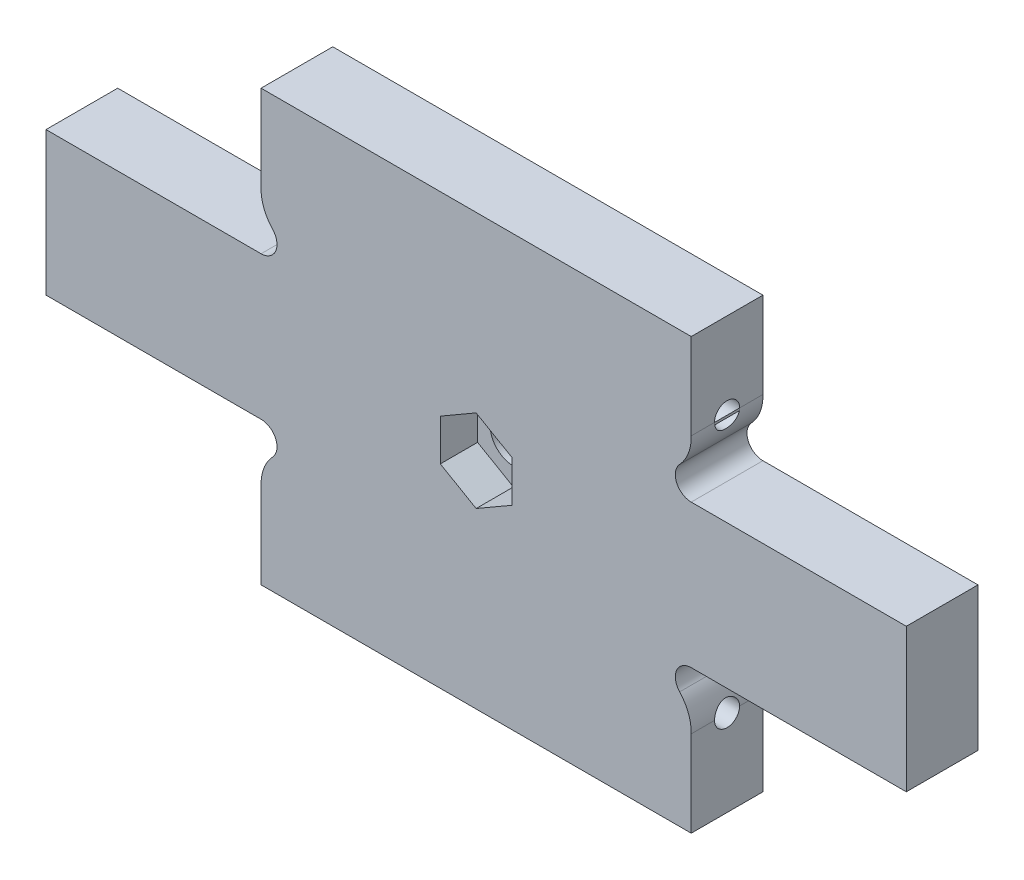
ISO-10303-21;
HEADER;
FILE_DESCRIPTION(('STEP AP214'),'2;1');
FILE_NAME('part.step','',(''),(''),'','','');
FILE_SCHEMA(('AUTOMOTIVE_DESIGN { 1 0 10303 214 1 1 1 1 }'));
ENDSEC;
DATA;
#1=APPLICATION_CONTEXT('core data for automotive mechanical design processes');
#2=APPLICATION_PROTOCOL_DEFINITION('international standard','automotive_design',2000,#1);
#3=PRODUCT_CONTEXT('',#1,'mechanical');
#4=PRODUCT('Part','Part','',(#3));
#5=PRODUCT_RELATED_PRODUCT_CATEGORY('part','',(#4));
#6=PRODUCT_DEFINITION_FORMATION('','',#4);
#7=PRODUCT_DEFINITION_CONTEXT('part definition',#1,'design');
#8=PRODUCT_DEFINITION('design','',#6,#7);
#9=PRODUCT_DEFINITION_SHAPE('','',#8);
#10=(LENGTH_UNIT() NAMED_UNIT(*) SI_UNIT(.MILLI.,.METRE.));
#11=(NAMED_UNIT(*) PLANE_ANGLE_UNIT() SI_UNIT($,.RADIAN.));
#12=(NAMED_UNIT(*) SI_UNIT($,.STERADIAN.) SOLID_ANGLE_UNIT());
#13=UNCERTAINTY_MEASURE_WITH_UNIT(LENGTH_MEASURE(1.E-05),#10,'distance_accuracy_value','');
#14=(GEOMETRIC_REPRESENTATION_CONTEXT(3) GLOBAL_UNCERTAINTY_ASSIGNED_CONTEXT((#13)) GLOBAL_UNIT_ASSIGNED_CONTEXT((#10,
#11,#12)) REPRESENTATION_CONTEXT('',''));
#15=CARTESIAN_POINT('',(0.,0.,0.));
#16=DIRECTION('',(0.,0.,1.));
#17=DIRECTION('',(1.,0.,0.));
#18=AXIS2_PLACEMENT_3D('',#15,#16,#17);
#19=CARTESIAN_POINT('',(-30.,30.,10.));
#20=DIRECTION('',(1.,0.,0.));
#21=DIRECTION('',(0.,0.,-1.));
#22=AXIS2_PLACEMENT_3D('',#19,#20,#21);
#23=PLANE('',#22);
#24=CARTESIAN_POINT('',(-30.,18.,5.));
#25=DIRECTION('',(-1.,0.,0.));
#26=DIRECTION('',(0.,0.,1.));
#27=AXIS2_PLACEMENT_3D('',#24,#25,#26);
#28=CIRCLE('',#27,1.74999999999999);
#29=CARTESIAN_POINT('',(-30.,18.,6.74999999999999));
#30=VERTEX_POINT('',#29);
#31=CARTESIAN_POINT('',(-30.,18.,3.25000000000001));
#32=VERTEX_POINT('',#31);
#33=EDGE_CURVE('E68',#30,#32,#28,.T.);
#34=ORIENTED_EDGE('',*,*,#33,.F.);
#35=DIRECTION('',(0.,0.,-1.));
#36=VECTOR('',#35,1.);
#37=CARTESIAN_POINT('',(-30.,18.,10.));
#38=LINE('',#37,#36);
#39=CARTESIAN_POINT('',(-30.,18.,10.));
#40=VERTEX_POINT('',#39);
#41=EDGE_CURVE('E487',#40,#30,#38,.T.);
#42=ORIENTED_EDGE('',*,*,#41,.F.);
#43=DIRECTION('',(0.,-1.,0.));
#44=VECTOR('',#43,1.);
#45=CARTESIAN_POINT('',(-30.,30.,10.));
#46=LINE('',#45,#44);
#47=CARTESIAN_POINT('',(-30.,30.,10.));
#48=VERTEX_POINT('',#47);
#49=EDGE_CURVE('E360',#48,#40,#46,.T.);
#50=ORIENTED_EDGE('',*,*,#49,.F.);
#51=DIRECTION('',(0.,0.,-1.));
#52=VECTOR('',#51,1.);
#53=CARTESIAN_POINT('',(-30.,30.,10.));
#54=LINE('',#53,#52);
#55=CARTESIAN_POINT('',(-30.,30.,0.));
#56=VERTEX_POINT('',#55);
#57=EDGE_CURVE('E490',#48,#56,#54,.T.);
#58=ORIENTED_EDGE('',*,*,#57,.T.);
#59=DIRECTION('',(0.,-1.,0.));
#60=VECTOR('',#59,1.);
#61=CARTESIAN_POINT('',(-30.,30.,0.));
#62=LINE('',#61,#60);
#63=CARTESIAN_POINT('',(-30.,18.,0.));
#64=VERTEX_POINT('',#63);
#65=EDGE_CURVE('E401',#56,#64,#62,.T.);
#66=ORIENTED_EDGE('',*,*,#65,.T.);
#67=EDGE_CURVE('E486',#32,#64,#38,.T.);
#68=ORIENTED_EDGE('',*,*,#67,.F.);
#69=EDGE_LOOP('',(#34,#42,#50,#58,#66,#68));
#70=FACE_BOUND('',#69,.T.);
#71=ADVANCED_FACE('F47',(#70),#23,.F.);
#72=CARTESIAN_POINT('',(30.,30.,10.));
#73=DIRECTION('',(-1.,0.,0.));
#74=DIRECTION('',(0.,0.,1.));
#75=AXIS2_PLACEMENT_3D('',#72,#73,#74);
#76=PLANE('',#75);
#77=CARTESIAN_POINT('',(30.,18.,5.));
#78=DIRECTION('',(1.,0.,0.));
#79=DIRECTION('',(0.,0.,-1.));
#80=AXIS2_PLACEMENT_3D('',#77,#78,#79);
#81=CIRCLE('',#80,1.74999999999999);
#82=CARTESIAN_POINT('',(30.,18.,3.25000000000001));
#83=VERTEX_POINT('',#82);
#84=CARTESIAN_POINT('',(30.,18.,6.74999999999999));
#85=VERTEX_POINT('',#84);
#86=EDGE_CURVE('E286',#83,#85,#81,.T.);
#87=ORIENTED_EDGE('',*,*,#86,.F.);
#88=DIRECTION('',(0.,0.,-1.));
#89=VECTOR('',#88,1.);
#90=CARTESIAN_POINT('',(30.,18.,10.));
#91=LINE('',#90,#89);
#92=CARTESIAN_POINT('',(30.,18.,0.));
#93=VERTEX_POINT('',#92);
#94=EDGE_CURVE('E497',#83,#93,#91,.T.);
#95=ORIENTED_EDGE('',*,*,#94,.T.);
#96=DIRECTION('',(0.,1.,0.));
#97=VECTOR('',#96,1.);
#98=CARTESIAN_POINT('',(30.,30.,0.));
#99=LINE('',#98,#97);
#100=CARTESIAN_POINT('',(30.,30.,0.));
#101=VERTEX_POINT('',#100);
#102=EDGE_CURVE('E397',#93,#101,#99,.T.);
#103=ORIENTED_EDGE('',*,*,#102,.T.);
#104=DIRECTION('',(0.,0.,-1.));
#105=VECTOR('',#104,1.);
#106=CARTESIAN_POINT('',(30.,30.,10.));
#107=LINE('',#106,#105);
#108=CARTESIAN_POINT('',(30.,30.,10.));
#109=VERTEX_POINT('',#108);
#110=EDGE_CURVE('E494',#109,#101,#107,.T.);
#111=ORIENTED_EDGE('',*,*,#110,.F.);
#112=DIRECTION('',(0.,1.,0.));
#113=VECTOR('',#112,1.);
#114=CARTESIAN_POINT('',(30.,30.,10.));
#115=LINE('',#114,#113);
#116=CARTESIAN_POINT('',(30.,18.,10.));
#117=VERTEX_POINT('',#116);
#118=EDGE_CURVE('E355',#117,#109,#115,.T.);
#119=ORIENTED_EDGE('',*,*,#118,.F.);
#120=EDGE_CURVE('E498',#117,#85,#91,.T.);
#121=ORIENTED_EDGE('',*,*,#120,.T.);
#122=EDGE_LOOP('',(#87,#95,#103,#111,#119,#121));
#123=FACE_BOUND('',#122,.T.);
#124=ADVANCED_FACE('F568',(#123),#76,.F.);
#125=CARTESIAN_POINT('',(0.,0.,0.));
#126=DIRECTION('',(0.,0.,1.));
#127=DIRECTION('',(1.,0.,0.));
#128=AXIS2_PLACEMENT_3D('',#125,#126,#127);
#129=CYLINDRICAL_SURFACE('',#128,3.25);
#130=CARTESIAN_POINT('',(0.,0.,0.));
#131=DIRECTION('',(0.,0.,1.));
#132=DIRECTION('',(1.,0.,0.));
#133=AXIS2_PLACEMENT_3D('',#130,#131,#132);
#134=CIRCLE('',#133,3.25);
#135=CARTESIAN_POINT('',(3.25,0.,0.));
#136=VERTEX_POINT('',#135);
#137=EDGE_CURVE('E348',#136,#136,#134,.T.);
#138=ORIENTED_EDGE('',*,*,#137,.F.);
#139=EDGE_LOOP('',(#138));
#140=FACE_BOUND('',#139,.T.);
#141=CARTESIAN_POINT('',(0.,0.,4.8));
#142=DIRECTION('',(0.,0.,1.));
#143=DIRECTION('',(1.,0.,0.));
#144=AXIS2_PLACEMENT_3D('',#141,#142,#143);
#145=CIRCLE('',#144,3.25);
#146=CARTESIAN_POINT('',(3.25,0.,4.8));
#147=VERTEX_POINT('',#146);
#148=EDGE_CURVE('E337',#147,#147,#145,.F.);
#149=ORIENTED_EDGE('',*,*,#148,.F.);
#150=EDGE_LOOP('',(#149));
#151=FACE_BOUND('',#150,.T.);
#152=ADVANCED_FACE('F565',(#140,#151),#129,.F.);
#153=CARTESIAN_POINT('',(24.0021116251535,17.8408301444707,10.));
#154=DIRECTION('',(0.,0.,-1.));
#155=DIRECTION('',(-1.,0.,0.));
#156=AXIS2_PLACEMENT_3D('',#153,#154,#155);
#157=CYLINDRICAL_SURFACE('',#156,6.00000000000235);
#158=CARTESIAN_POINT('',(30.,17.6816602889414,3.2791979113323));
#159=CARTESIAN_POINT('',(29.9987313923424,17.6337424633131,3.28806184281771));
#160=CARTESIAN_POINT('',(29.9968924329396,17.5862353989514,3.29892223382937));
#161=CARTESIAN_POINT('',(29.9921670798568,17.4923496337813,3.32454189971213));
#162=CARTESIAN_POINT('',(29.989280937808,17.4459706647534,3.33930023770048));
#163=CARTESIAN_POINT('',(29.9792095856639,17.3092146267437,3.38919308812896));
#164=CARTESIAN_POINT('',(29.9706030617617,17.2209391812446,3.42999758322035));
#165=CARTESIAN_POINT('',(29.9507233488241,17.0526542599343,3.52541371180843));
#166=CARTESIAN_POINT('',(29.9394511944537,16.9726415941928,3.5800199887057));
#167=CARTESIAN_POINT('',(29.9155983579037,16.8227748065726,3.70155930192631));
#168=CARTESIAN_POINT('',(29.9030172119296,16.7529243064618,3.7684967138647));
#169=CARTESIAN_POINT('',(29.8777467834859,16.6237217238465,3.91460477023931));
#170=CARTESIAN_POINT('',(29.8650614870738,16.5646427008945,3.99401777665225));
#171=CARTESIAN_POINT('',(29.8414450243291,16.4605977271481,4.16185492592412));
#172=CARTESIAN_POINT('',(29.8305138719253,16.4156318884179,4.25027914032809));
#173=CARTESIAN_POINT('',(29.8118198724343,16.3412405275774,4.43361922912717));
#174=CARTESIAN_POINT('',(29.8040524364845,16.3117924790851,4.52852546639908));
#175=CARTESIAN_POINT('',(29.7927035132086,16.2693540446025,4.72218092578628));
#176=CARTESIAN_POINT('',(29.7891208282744,16.256358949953,4.82092904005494));
#177=CARTESIAN_POINT('',(29.7866706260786,16.2474389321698,5.0160343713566));
#178=CARTESIAN_POINT('',(29.7876541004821,16.2509745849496,5.1123653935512));
#179=CARTESIAN_POINT('',(29.7938668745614,16.2737603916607,5.30300554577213));
#180=CARTESIAN_POINT('',(29.7990961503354,16.2930104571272,5.39731468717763));
#181=CARTESIAN_POINT('',(29.8130743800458,16.3463546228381,5.58050609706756));
#182=CARTESIAN_POINT('',(29.8217943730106,16.380326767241,5.66942625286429));
#183=CARTESIAN_POINT('',(29.8416979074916,16.4620650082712,5.84037847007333));
#184=CARTESIAN_POINT('',(29.852881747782,16.5098327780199,5.92240969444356));
#185=CARTESIAN_POINT('',(29.8767647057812,16.6194848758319,6.07988667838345));
#186=CARTESIAN_POINT('',(29.889498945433,16.6817461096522,6.15506471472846));
#187=CARTESIAN_POINT('',(29.914681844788,16.8179421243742,6.2941067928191));
#188=CARTESIAN_POINT('',(29.9271303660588,16.8918824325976,6.3579654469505));
#189=CARTESIAN_POINT('',(29.9504593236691,17.0510508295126,6.47372665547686));
#190=CARTESIAN_POINT('',(29.9613048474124,17.1364692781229,6.52537458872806));
#191=CARTESIAN_POINT('',(29.9797000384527,17.3150510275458,6.61344855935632));
#192=CARTESIAN_POINT('',(29.9872558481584,17.4081995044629,6.64990295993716));
#193=CARTESIAN_POINT('',(29.9942830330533,17.5330112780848,6.68681922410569));
#194=CARTESIAN_POINT('',(29.9957265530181,17.5625013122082,6.69470639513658));
#195=CARTESIAN_POINT('',(29.9981864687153,17.6218268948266,6.70892101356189));
#196=CARTESIAN_POINT('',(29.9992034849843,17.6516618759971,6.71525072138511));
#197=CARTESIAN_POINT('',(30.,17.6816602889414,6.7208020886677));
#198=B_SPLINE_CURVE_WITH_KNOTS('',3,(#158,#159,#160,#161,#162,#163,#164,#165,#166,#167,#168,
#169,#170,#171,#172,#173,#174,#175,#176,#177,#178,#179,#180,#181,#182,#183,#184,#185,#186,#187,
#188,#189,#190,#191,#192,#193,#194,#195,#196,#197),.UNSPECIFIED.,.F.,.F.,(4,2,2,2,2,2,2,2,2,2,2,
2,2,2,2,2,2,2,2,4),(0.,0.146146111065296,0.292257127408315,0.583637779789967,0.874905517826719,
1.16627680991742,1.46423562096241,1.76219679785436,2.05972423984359,2.35716651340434,
2.64497179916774,2.93277546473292,3.21823925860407,3.50373768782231,3.79770983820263,
4.09182153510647,4.39161125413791,4.69083879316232,4.78248931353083,4.87400602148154),.UNSPECIFIED.);
#199=CARTESIAN_POINT('',(30.,17.6816602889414,3.27919791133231));
#200=VERTEX_POINT('',#199);
#201=CARTESIAN_POINT('',(30.,17.6816602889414,6.7208020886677));
#202=VERTEX_POINT('',#201);
#203=EDGE_CURVE('E513',#200,#202,#198,.T.);
#204=ORIENTED_EDGE('',*,*,#203,.T.);
#205=DIRECTION('',(0.,0.,-1.));
#206=VECTOR('',#205,1.);
#207=CARTESIAN_POINT('',(30.,17.6816602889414,10.));
#208=LINE('',#207,#206);
#209=EDGE_CURVE('E655',#202,#200,#208,.T.);
#210=ORIENTED_EDGE('',*,*,#209,.T.);
#211=EDGE_LOOP('',(#204,#210));
#212=FACE_BOUND('',#211,.T.);
#213=CARTESIAN_POINT('',(24.0021116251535,17.8408301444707,0.));
#214=DIRECTION('',(0.,0.,1.));
#215=DIRECTION('',(-1.,0.,0.));
#216=AXIS2_PLACEMENT_3D('',#213,#214,#215);
#217=CIRCLE('',#216,6.00000000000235);
#218=CARTESIAN_POINT('',(28.3795620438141,13.7374257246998,0.));
#219=VERTEX_POINT('',#218);
#220=EDGE_CURVE('E351',#219,#93,#217,.T.);
#221=ORIENTED_EDGE('',*,*,#220,.T.);
#222=ORIENTED_EDGE('',*,*,#94,.F.);
#223=EDGE_CURVE('E502',#85,#83,#91,.T.);
#224=ORIENTED_EDGE('',*,*,#223,.F.);
#225=ORIENTED_EDGE('',*,*,#120,.F.);
#226=CARTESIAN_POINT('',(24.0021116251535,17.8408301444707,10.));
#227=DIRECTION('',(0.,0.,1.));
#228=DIRECTION('',(-1.,0.,0.));
#229=AXIS2_PLACEMENT_3D('',#226,#227,#228);
#230=CIRCLE('',#229,6.00000000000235);
#231=CARTESIAN_POINT('',(28.3795620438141,13.7374257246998,10.));
#232=VERTEX_POINT('',#231);
#233=EDGE_CURVE('E352',#232,#117,#230,.T.);
#234=ORIENTED_EDGE('',*,*,#233,.F.);
#235=DIRECTION('',(0.,0.,-1.));
#236=VECTOR('',#235,1.);
#237=CARTESIAN_POINT('',(28.3795620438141,13.7374257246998,10.));
#238=LINE('',#237,#236);
#239=EDGE_CURVE('E394',#232,#219,#238,.T.);
#240=ORIENTED_EDGE('',*,*,#239,.T.);
#241=EDGE_LOOP('',(#221,#222,#224,#225,#234,#240));
#242=FACE_BOUND('',#241,.T.);
#243=ADVANCED_FACE('F49',(#212,#242),#157,.T.);
#244=CARTESIAN_POINT('',(30.,30.,10.));
#245=DIRECTION('',(0.,-1.,0.));
#246=DIRECTION('',(1.,0.,0.));
#247=AXIS2_PLACEMENT_3D('',#244,#245,#246);
#248=PLANE('',#247);
#249=DIRECTION('',(-1.,0.,0.));
#250=VECTOR('',#249,1.);
#251=CARTESIAN_POINT('',(30.,30.,0.));
#252=LINE('',#251,#250);
#253=EDGE_CURVE('E399',#101,#56,#252,.T.);
#254=ORIENTED_EDGE('',*,*,#253,.T.);
#255=ORIENTED_EDGE('',*,*,#57,.F.);
#256=DIRECTION('',(-1.,0.,0.));
#257=VECTOR('',#256,1.);
#258=CARTESIAN_POINT('',(30.,30.,10.));
#259=LINE('',#258,#257);
#260=EDGE_CURVE('E358',#109,#48,#259,.T.);
#261=ORIENTED_EDGE('',*,*,#260,.F.);
#262=ORIENTED_EDGE('',*,*,#110,.T.);
#263=EDGE_LOOP('',(#254,#255,#261,#262));
#264=FACE_BOUND('',#263,.T.);
#265=ADVANCED_FACE('F615',(#264),#248,.F.);
#266=CARTESIAN_POINT('',(-24.0021116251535,17.8408301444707,10.));
#267=DIRECTION('',(0.,0.,-1.));
#268=DIRECTION('',(-1.,0.,0.));
#269=AXIS2_PLACEMENT_3D('',#266,#267,#268);
#270=CYLINDRICAL_SURFACE('',#269,6.00000000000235);
#271=CARTESIAN_POINT('',(-30.,17.6816602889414,6.7208020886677));
#272=CARTESIAN_POINT('',(-29.9987313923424,17.6337424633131,6.71193815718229));
#273=CARTESIAN_POINT('',(-29.9968924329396,17.5862353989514,6.70107776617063));
#274=CARTESIAN_POINT('',(-29.9921670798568,17.4923496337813,6.67545810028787));
#275=CARTESIAN_POINT('',(-29.989280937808,17.4459706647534,6.66069976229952));
#276=CARTESIAN_POINT('',(-29.9792095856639,17.3092146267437,6.61080691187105));
#277=CARTESIAN_POINT('',(-29.9706030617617,17.2209391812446,6.57000241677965));
#278=CARTESIAN_POINT('',(-29.9507233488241,17.0526542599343,6.47458628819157));
#279=CARTESIAN_POINT('',(-29.9394511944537,16.9726415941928,6.4199800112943));
#280=CARTESIAN_POINT('',(-29.9155983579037,16.8227748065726,6.29844069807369));
#281=CARTESIAN_POINT('',(-29.9030172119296,16.7529243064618,6.2315032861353));
#282=CARTESIAN_POINT('',(-29.8777467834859,16.6237217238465,6.08539522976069));
#283=CARTESIAN_POINT('',(-29.8650614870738,16.5646427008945,6.00598222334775));
#284=CARTESIAN_POINT('',(-29.8414450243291,16.4605977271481,5.83814507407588));
#285=CARTESIAN_POINT('',(-29.8305138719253,16.4156318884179,5.74972085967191));
#286=CARTESIAN_POINT('',(-29.8118198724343,16.3412405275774,5.56638077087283));
#287=CARTESIAN_POINT('',(-29.8040524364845,16.3117924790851,5.47147453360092));
#288=CARTESIAN_POINT('',(-29.7927035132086,16.2693540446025,5.27781907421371));
#289=CARTESIAN_POINT('',(-29.7891208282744,16.256358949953,5.17907095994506));
#290=CARTESIAN_POINT('',(-29.7866706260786,16.2474389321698,4.9839656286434));
#291=CARTESIAN_POINT('',(-29.7876541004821,16.2509745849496,4.8876346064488));
#292=CARTESIAN_POINT('',(-29.7938668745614,16.2737603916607,4.69699445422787));
#293=CARTESIAN_POINT('',(-29.7990961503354,16.2930104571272,4.60268531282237));
#294=CARTESIAN_POINT('',(-29.8130743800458,16.3463546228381,4.41949390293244));
#295=CARTESIAN_POINT('',(-29.8217943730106,16.380326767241,4.33057374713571));
#296=CARTESIAN_POINT('',(-29.8416979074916,16.4620650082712,4.15962152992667));
#297=CARTESIAN_POINT('',(-29.852881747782,16.5098327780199,4.07759030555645));
#298=CARTESIAN_POINT('',(-29.8767647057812,16.6194848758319,3.92011332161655));
#299=CARTESIAN_POINT('',(-29.889498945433,16.6817461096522,3.84493528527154));
#300=CARTESIAN_POINT('',(-29.914681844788,16.8179421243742,3.7058932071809));
#301=CARTESIAN_POINT('',(-29.9271303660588,16.8918824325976,3.6420345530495));
#302=CARTESIAN_POINT('',(-29.9504593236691,17.0510508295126,3.52627334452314));
#303=CARTESIAN_POINT('',(-29.9613048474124,17.1364692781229,3.47462541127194));
#304=CARTESIAN_POINT('',(-29.9797000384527,17.3150510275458,3.38655144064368));
#305=CARTESIAN_POINT('',(-29.9872558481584,17.4081995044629,3.35009704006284));
#306=CARTESIAN_POINT('',(-29.9942830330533,17.5330112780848,3.31318077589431));
#307=CARTESIAN_POINT('',(-29.9957265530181,17.5625013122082,3.30529360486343));
#308=CARTESIAN_POINT('',(-29.9981864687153,17.6218268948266,3.29107898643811));
#309=CARTESIAN_POINT('',(-29.9992034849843,17.6516618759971,3.28474927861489));
#310=CARTESIAN_POINT('',(-30.,17.6816602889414,3.2791979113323));
#311=B_SPLINE_CURVE_WITH_KNOTS('',3,(#271,#272,#273,#274,#275,#276,#277,#278,#279,#280,#281,
#282,#283,#284,#285,#286,#287,#288,#289,#290,#291,#292,#293,#294,#295,#296,#297,#298,#299,#300,
#301,#302,#303,#304,#305,#306,#307,#308,#309,#310),.UNSPECIFIED.,.F.,.F.,(4,2,2,2,2,2,2,2,2,2,2,
2,2,2,2,2,2,2,2,4),(0.,0.146146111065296,0.292257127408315,0.583637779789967,0.874905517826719,
1.16627680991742,1.46423562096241,1.76219679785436,2.05972423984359,2.35716651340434,
2.64497179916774,2.93277546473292,3.21823925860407,3.50373768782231,3.79770983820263,
4.09182153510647,4.39161125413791,4.69083879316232,4.78248931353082,4.87400602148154),.UNSPECIFIED.);
#312=CARTESIAN_POINT('',(-30.,17.6816602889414,6.72080208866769));
#313=VERTEX_POINT('',#312);
#314=CARTESIAN_POINT('',(-30.,17.6816602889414,3.2791979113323));
#315=VERTEX_POINT('',#314);
#316=EDGE_CURVE('E56',#313,#315,#311,.T.);
#317=ORIENTED_EDGE('',*,*,#316,.T.);
#318=DIRECTION('',(0.,0.,-1.));
#319=VECTOR('',#318,1.);
#320=CARTESIAN_POINT('',(-30.,17.6816602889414,10.));
#321=LINE('',#320,#319);
#322=EDGE_CURVE('E11',#315,#313,#321,.F.);
#323=ORIENTED_EDGE('',*,*,#322,.T.);
#324=EDGE_LOOP('',(#317,#323));
#325=FACE_BOUND('',#324,.T.);
#326=CARTESIAN_POINT('',(-24.0021116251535,17.8408301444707,0.));
#327=DIRECTION('',(0.,0.,1.));
#328=DIRECTION('',(1.,0.,0.));
#329=AXIS2_PLACEMENT_3D('',#326,#327,#328);
#330=CIRCLE('',#329,6.00000000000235);
#331=CARTESIAN_POINT('',(-28.3795620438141,13.7374257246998,0.));
#332=VERTEX_POINT('',#331);
#333=EDGE_CURVE('E404',#64,#332,#330,.T.);
#334=ORIENTED_EDGE('',*,*,#333,.T.);
#335=DIRECTION('',(0.,0.,-1.));
#336=VECTOR('',#335,1.);
#337=CARTESIAN_POINT('',(-28.3795620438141,13.7374257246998,10.));
#338=LINE('',#337,#336);
#339=CARTESIAN_POINT('',(-28.3795620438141,13.7374257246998,10.));
#340=VERTEX_POINT('',#339);
#341=EDGE_CURVE('E483',#340,#332,#338,.T.);
#342=ORIENTED_EDGE('',*,*,#341,.F.);
#343=CARTESIAN_POINT('',(-24.0021116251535,17.8408301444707,10.));
#344=DIRECTION('',(0.,0.,1.));
#345=DIRECTION('',(1.,0.,0.));
#346=AXIS2_PLACEMENT_3D('',#343,#344,#345);
#347=CIRCLE('',#346,6.00000000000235);
#348=EDGE_CURVE('E362',#40,#340,#347,.T.);
#349=ORIENTED_EDGE('',*,*,#348,.F.);
#350=ORIENTED_EDGE('',*,*,#41,.T.);
#351=EDGE_CURVE('E491',#30,#32,#38,.T.);
#352=ORIENTED_EDGE('',*,*,#351,.T.);
#353=ORIENTED_EDGE('',*,*,#67,.T.);
#354=EDGE_LOOP('',(#334,#342,#349,#350,#352,#353));
#355=FACE_BOUND('',#354,.T.);
#356=ADVANCED_FACE('F612',(#325,#355),#270,.T.);
#357=CARTESIAN_POINT('',(-30.000000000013,12.2199999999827,10.));
#358=DIRECTION('',(0.,0.,-1.));
#359=DIRECTION('',(-1.,0.,0.));
#360=AXIS2_PLACEMENT_3D('',#357,#358,#359);
#361=CYLINDRICAL_SURFACE('',#360,2.21999999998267);
#362=CARTESIAN_POINT('',(-30.000000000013,12.2199999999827,0.));
#363=DIRECTION('',(0.,0.,-1.));
#364=DIRECTION('',(1.,0.,0.));
#365=AXIS2_PLACEMENT_3D('',#362,#363,#364);
#366=CIRCLE('',#365,2.21999999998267);
#367=CARTESIAN_POINT('',(-30.000000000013,10.,0.));
#368=VERTEX_POINT('',#367);
#369=EDGE_CURVE('E406',#332,#368,#366,.T.);
#370=ORIENTED_EDGE('',*,*,#369,.T.);
#371=DIRECTION('',(0.,0.,-1.));
#372=VECTOR('',#371,1.);
#373=CARTESIAN_POINT('',(-30.000000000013,10.,10.));
#374=LINE('',#373,#372);
#375=CARTESIAN_POINT('',(-30.000000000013,10.,10.));
#376=VERTEX_POINT('',#375);
#377=EDGE_CURVE('E480',#376,#368,#374,.T.);
#378=ORIENTED_EDGE('',*,*,#377,.F.);
#379=CARTESIAN_POINT('',(-30.000000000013,12.2199999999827,10.));
#380=DIRECTION('',(0.,0.,-1.));
#381=DIRECTION('',(1.,0.,0.));
#382=AXIS2_PLACEMENT_3D('',#379,#380,#381);
#383=CIRCLE('',#382,2.21999999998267);
#384=EDGE_CURVE('E364',#340,#376,#383,.T.);
#385=ORIENTED_EDGE('',*,*,#384,.F.);
#386=ORIENTED_EDGE('',*,*,#341,.T.);
#387=EDGE_LOOP('',(#370,#378,#385,#386));
#388=FACE_BOUND('',#387,.T.);
#389=ADVANCED_FACE('F621',(#388),#361,.F.);
#390=CARTESIAN_POINT('',(-30.000000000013,10.,10.));
#391=DIRECTION('',(0.,-1.,0.));
#392=DIRECTION('',(0.,0.,-1.));
#393=AXIS2_PLACEMENT_3D('',#390,#391,#392);
#394=PLANE('',#393);
#395=DIRECTION('',(-1.,0.,0.));
#396=VECTOR('',#395,1.);
#397=CARTESIAN_POINT('',(-30.000000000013,10.,0.));
#398=LINE('',#397,#396);
#399=CARTESIAN_POINT('',(-60.,10.,0.));
#400=VERTEX_POINT('',#399);
#401=EDGE_CURVE('E408',#368,#400,#398,.T.);
#402=ORIENTED_EDGE('',*,*,#401,.T.);
#403=DIRECTION('',(0.,0.,-1.));
#404=VECTOR('',#403,1.);
#405=CARTESIAN_POINT('',(-60.,10.,10.));
#406=LINE('',#405,#404);
#407=CARTESIAN_POINT('',(-60.,10.,10.));
#408=VERTEX_POINT('',#407);
#409=EDGE_CURVE('E477',#408,#400,#406,.T.);
#410=ORIENTED_EDGE('',*,*,#409,.F.);
#411=DIRECTION('',(-1.,0.,0.));
#412=VECTOR('',#411,1.);
#413=CARTESIAN_POINT('',(-30.000000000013,10.,10.));
#414=LINE('',#413,#412);
#415=EDGE_CURVE('E366',#376,#408,#414,.T.);
#416=ORIENTED_EDGE('',*,*,#415,.F.);
#417=ORIENTED_EDGE('',*,*,#377,.T.);
#418=EDGE_LOOP('',(#402,#410,#416,#417));
#419=FACE_BOUND('',#418,.T.);
#420=ADVANCED_FACE('F758',(#419),#394,.F.);
#421=CARTESIAN_POINT('',(-60.,10.,10.));
#422=DIRECTION('',(1.,0.,0.));
#423=DIRECTION('',(0.,0.,-1.));
#424=AXIS2_PLACEMENT_3D('',#421,#422,#423);
#425=PLANE('',#424);
#426=DIRECTION('',(0.,-1.,0.));
#427=VECTOR('',#426,1.);
#428=CARTESIAN_POINT('',(-60.,10.,0.));
#429=LINE('',#428,#427);
#430=CARTESIAN_POINT('',(-60.,-10.,0.));
#431=VERTEX_POINT('',#430);
#432=EDGE_CURVE('E410',#400,#431,#429,.T.);
#433=ORIENTED_EDGE('',*,*,#432,.T.);
#434=DIRECTION('',(0.,0.,-1.));
#435=VECTOR('',#434,1.);
#436=CARTESIAN_POINT('',(-60.,-10.,10.));
#437=LINE('',#436,#435);
#438=CARTESIAN_POINT('',(-60.,-10.,10.));
#439=VERTEX_POINT('',#438);
#440=EDGE_CURVE('E474',#439,#431,#437,.T.);
#441=ORIENTED_EDGE('',*,*,#440,.F.);
#442=DIRECTION('',(0.,-1.,0.));
#443=VECTOR('',#442,1.);
#444=CARTESIAN_POINT('',(-60.,10.,10.));
#445=LINE('',#444,#443);
#446=EDGE_CURVE('E368',#408,#439,#445,.T.);
#447=ORIENTED_EDGE('',*,*,#446,.F.);
#448=ORIENTED_EDGE('',*,*,#409,.T.);
#449=EDGE_LOOP('',(#433,#441,#447,#448));
#450=FACE_BOUND('',#449,.T.);
#451=ADVANCED_FACE('F756',(#450),#425,.F.);
#452=CARTESIAN_POINT('',(-60.,-10.,10.));
#453=DIRECTION('',(0.,1.,0.));
#454=DIRECTION('',(-1.,0.,0.));
#455=AXIS2_PLACEMENT_3D('',#452,#453,#454);
#456=PLANE('',#455);
#457=DIRECTION('',(1.,0.,0.));
#458=VECTOR('',#457,1.);
#459=CARTESIAN_POINT('',(-60.,-10.,0.));
#460=LINE('',#459,#458);
#461=CARTESIAN_POINT('',(-30.000000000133,-9.99999999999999,0.));
#462=VERTEX_POINT('',#461);
#463=EDGE_CURVE('E412',#431,#462,#460,.T.);
#464=ORIENTED_EDGE('',*,*,#463,.T.);
#465=DIRECTION('',(0.,0.,-1.));
#466=VECTOR('',#465,1.);
#467=CARTESIAN_POINT('',(-30.000000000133,-9.99999999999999,10.));
#468=LINE('',#467,#466);
#469=CARTESIAN_POINT('',(-30.000000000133,-9.99999999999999,10.));
#470=VERTEX_POINT('',#469);
#471=EDGE_CURVE('E471',#470,#462,#468,.T.);
#472=ORIENTED_EDGE('',*,*,#471,.F.);
#473=DIRECTION('',(1.,0.,0.));
#474=VECTOR('',#473,1.);
#475=CARTESIAN_POINT('',(-60.,-10.,10.));
#476=LINE('',#475,#474);
#477=EDGE_CURVE('E370',#439,#470,#476,.T.);
#478=ORIENTED_EDGE('',*,*,#477,.F.);
#479=ORIENTED_EDGE('',*,*,#440,.T.);
#480=EDGE_LOOP('',(#464,#472,#478,#479));
#481=FACE_BOUND('',#480,.T.);
#482=ADVANCED_FACE('F751',(#481),#456,.F.);
#483=CARTESIAN_POINT('',(-30.000000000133,-12.2200000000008,10.));
#484=DIRECTION('',(0.,0.,-1.));
#485=DIRECTION('',(-1.,0.,0.));
#486=AXIS2_PLACEMENT_3D('',#483,#484,#485);
#487=CYLINDRICAL_SURFACE('',#486,2.22000000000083);
#488=CARTESIAN_POINT('',(-30.000000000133,-12.2200000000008,0.));
#489=DIRECTION('',(0.,0.,-1.));
#490=DIRECTION('',(1.,0.,0.));
#491=AXIS2_PLACEMENT_3D('',#488,#489,#490);
#492=CIRCLE('',#491,2.22000000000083);
#493=CARTESIAN_POINT('',(-28.3795620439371,-13.7374257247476,0.));
#494=VERTEX_POINT('',#493);
#495=EDGE_CURVE('E414',#462,#494,#492,.T.);
#496=ORIENTED_EDGE('',*,*,#495,.T.);
#497=DIRECTION('',(0.,0.,-1.));
#498=VECTOR('',#497,1.);
#499=CARTESIAN_POINT('',(-28.3795620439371,-13.7374257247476,10.));
#500=LINE('',#499,#498);
#501=CARTESIAN_POINT('',(-28.3795620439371,-13.7374257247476,10.));
#502=VERTEX_POINT('',#501);
#503=EDGE_CURVE('E468',#502,#494,#500,.T.);
#504=ORIENTED_EDGE('',*,*,#503,.F.);
#505=CARTESIAN_POINT('',(-30.000000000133,-12.2200000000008,10.));
#506=DIRECTION('',(0.,0.,-1.));
#507=DIRECTION('',(1.,0.,0.));
#508=AXIS2_PLACEMENT_3D('',#505,#506,#507);
#509=CIRCLE('',#508,2.22000000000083);
#510=EDGE_CURVE('E372',#470,#502,#509,.T.);
#511=ORIENTED_EDGE('',*,*,#510,.F.);
#512=ORIENTED_EDGE('',*,*,#471,.T.);
#513=EDGE_LOOP('',(#496,#504,#511,#512));
#514=FACE_BOUND('',#513,.T.);
#515=ADVANCED_FACE('F746',(#514),#487,.F.);
#516=CARTESIAN_POINT('',(-24.0000000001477,-17.8385763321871,10.));
#517=DIRECTION('',(0.,0.,-1.));
#518=DIRECTION('',(-1.,0.,0.));
#519=AXIS2_PLACEMENT_3D('',#516,#517,#518);
#520=CYLINDRICAL_SURFACE('',#519,6.00000000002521);
#521=DIRECTION('',(0.,0.,-1.));
#522=VECTOR('',#521,1.);
#523=CARTESIAN_POINT('',(-29.9978281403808,-18.,10.));
#524=LINE('',#523,#522);
#525=CARTESIAN_POINT('',(-29.9978281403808,-18.,3.25000000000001));
#526=VERTEX_POINT('',#525);
#527=CARTESIAN_POINT('',(-29.9978281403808,-18.,0.));
#528=VERTEX_POINT('',#527);
#529=EDGE_CURVE('E464',#526,#528,#524,.T.);
#530=ORIENTED_EDGE('',*,*,#529,.F.);
#531=CARTESIAN_POINT('',(-29.9978281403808,-18.,3.25000000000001));
#532=CARTESIAN_POINT('',(-29.9991213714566,-17.9520643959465,3.24999922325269));
#533=CARTESIAN_POINT('',(-29.9998323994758,-17.9041364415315,3.25197087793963));
#534=CARTESIAN_POINT('',(-30.000114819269,-17.8086077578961,3.25983702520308));
#535=CARTESIAN_POINT('',(-29.9996863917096,-17.7610069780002,3.26573089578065));
#536=CARTESIAN_POINT('',(-29.9967354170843,-17.6194289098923,3.28921586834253));
#537=CARTESIAN_POINT('',(-29.9925547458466,-17.5263796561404,3.31261066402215));
#538=CARTESIAN_POINT('',(-29.9804039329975,-17.3456267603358,3.37413859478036));
#539=CARTESIAN_POINT('',(-29.9724339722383,-17.2579228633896,3.41227102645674));
#540=CARTESIAN_POINT('',(-29.9537286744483,-17.0900779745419,3.50213360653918));
#541=CARTESIAN_POINT('',(-29.9429925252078,-17.0099392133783,3.55386774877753));
#542=CARTESIAN_POINT('',(-29.9197837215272,-16.8576436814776,3.67074012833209));
#543=CARTESIAN_POINT('',(-29.9072790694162,-16.7856922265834,3.7361393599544));
#544=CARTESIAN_POINT('',(-29.8822022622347,-16.6535752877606,3.87793332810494));
#545=CARTESIAN_POINT('',(-29.8696300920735,-16.5934125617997,3.95433063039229));
#546=CARTESIAN_POINT('',(-29.8456500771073,-16.4852381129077,4.11804831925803));
#547=CARTESIAN_POINT('',(-29.8342754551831,-16.4375359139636,4.20557863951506));
#548=CARTESIAN_POINT('',(-29.8144966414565,-16.3575847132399,4.3877415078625));
#549=CARTESIAN_POINT('',(-29.8060918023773,-16.3253323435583,4.4823725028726));
#550=CARTESIAN_POINT('',(-29.7935011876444,-16.2778257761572,4.67414129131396));
#551=CARTESIAN_POINT('',(-29.7892371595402,-16.2622557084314,4.77119552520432));
#552=CARTESIAN_POINT('',(-29.7852212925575,-16.2475776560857,4.96662732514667));
#553=CARTESIAN_POINT('',(-29.7854686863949,-16.2484668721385,5.06500466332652));
#554=CARTESIAN_POINT('',(-29.7903669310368,-16.266403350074,5.25729660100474));
#555=CARTESIAN_POINT('',(-29.7948912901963,-16.2829864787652,5.35125827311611));
#556=CARTESIAN_POINT('',(-29.8075880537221,-16.3310838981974,5.5350151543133));
#557=CARTESIAN_POINT('',(-29.8157607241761,-16.3625992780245,5.62481005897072));
#558=CARTESIAN_POINT('',(-29.8348616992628,-16.4400104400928,5.79881083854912));
#559=CARTESIAN_POINT('',(-29.8458186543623,-16.48605702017,5.88294633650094));
#560=CARTESIAN_POINT('',(-29.8691380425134,-16.5911361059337,6.04246270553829));
#561=CARTESIAN_POINT('',(-29.8815007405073,-16.6501710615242,6.11784192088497));
#562=CARTESIAN_POINT('',(-29.9065961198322,-16.7818142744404,6.26024764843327));
#563=CARTESIAN_POINT('',(-29.919327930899,-16.8547975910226,6.32692811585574));
#564=CARTESIAN_POINT('',(-29.943195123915,-17.0111270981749,6.44718842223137));
#565=CARTESIAN_POINT('',(-29.9543301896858,-17.0944753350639,6.50076566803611));
#566=CARTESIAN_POINT('',(-29.973589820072,-17.2693897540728,6.59327094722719));
#567=CARTESIAN_POINT('',(-29.9817108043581,-17.3609655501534,6.63218155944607));
#568=CARTESIAN_POINT('',(-29.9937773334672,-17.5495816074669,6.69394119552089));
#569=CARTESIAN_POINT('',(-29.997728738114,-17.6466139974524,6.71681274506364));
#570=CARTESIAN_POINT('',(-29.9999295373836,-17.7870780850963,6.73752704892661));
#571=CARTESIAN_POINT('',(-30.0001445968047,-17.8295681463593,6.74220582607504));
#572=CARTESIAN_POINT('',(-29.9996677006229,-17.914702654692,6.74843918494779));
#573=CARTESIAN_POINT('',(-29.9989772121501,-17.9573467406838,6.74999880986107));
#574=CARTESIAN_POINT('',(-29.9978281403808,-18.,6.75000000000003));
#575=B_SPLINE_CURVE_WITH_KNOTS('',3,(#531,#532,#533,#534,#535,#536,#537,#538,#539,#540,#541,
#542,#543,#544,#545,#546,#547,#548,#549,#550,#551,#552,#553,#554,#555,#556,#557,#558,#559,#560,
#561,#562,#563,#564,#565,#566,#567,#568,#569,#570,#571,#572,#573,#574),.UNSPECIFIED.,.F.,.F.,(4,
2,2,2,2,2,2,2,2,2,2,2,2,2,2,2,2,2,2,2,2,4),(0.,0.143768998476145,0.28751520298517,
0.57413023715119,0.860731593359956,1.14741719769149,1.44018255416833,1.73301632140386,
2.03255040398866,2.33201916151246,2.62571161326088,2.9193541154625,3.20457514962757,
3.489816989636,3.77812206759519,4.06648157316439,4.36410291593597,4.66178311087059,
4.95981578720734,5.2574290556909,5.38556886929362,5.51350133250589),.UNSPECIFIED.);
#576=CARTESIAN_POINT('',(-29.9978281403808,-18.,6.74999999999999));
#577=VERTEX_POINT('',#576);
#578=EDGE_CURVE('E653',#526,#577,#575,.T.);
#579=ORIENTED_EDGE('',*,*,#578,.T.);
#580=CARTESIAN_POINT('',(-29.9978281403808,-18.,10.));
#581=VERTEX_POINT('',#580);
#582=EDGE_CURVE('E465',#581,#577,#524,.T.);
#583=ORIENTED_EDGE('',*,*,#582,.F.);
#584=CARTESIAN_POINT('',(-24.0000000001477,-17.8385763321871,10.));
#585=DIRECTION('',(0.,0.,1.));
#586=DIRECTION('',(1.,0.,0.));
#587=AXIS2_PLACEMENT_3D('',#584,#585,#586);
#588=CIRCLE('',#587,6.00000000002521);
#589=EDGE_CURVE('E374',#502,#581,#588,.T.);
#590=ORIENTED_EDGE('',*,*,#589,.F.);
#591=ORIENTED_EDGE('',*,*,#503,.T.);
#592=CARTESIAN_POINT('',(-24.0000000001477,-17.8385763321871,0.));
#593=DIRECTION('',(0.,0.,1.));
#594=DIRECTION('',(1.,0.,0.));
#595=AXIS2_PLACEMENT_3D('',#592,#593,#594);
#596=CIRCLE('',#595,6.00000000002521);
#597=EDGE_CURVE('E416',#494,#528,#596,.T.);
#598=ORIENTED_EDGE('',*,*,#597,.T.);
#599=EDGE_LOOP('',(#530,#579,#583,#590,#591,#598));
#600=FACE_BOUND('',#599,.T.);
#601=ADVANCED_FACE('F740',(#600),#520,.T.);
#602=CARTESIAN_POINT('',(-29.9978281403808,-18.,10.));
#603=DIRECTION('',(1.,0.,0.));
#604=DIRECTION('',(0.,0.,-1.));
#605=AXIS2_PLACEMENT_3D('',#602,#603,#604);
#606=PLANE('',#605);
#607=ORIENTED_EDGE('',*,*,#582,.T.);
#608=CARTESIAN_POINT('',(-29.9978281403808,-18.,5.));
#609=DIRECTION('',(1.,0.,0.));
#610=DIRECTION('',(0.,0.,-1.));
#611=AXIS2_PLACEMENT_3D('',#608,#609,#610);
#612=CIRCLE('',#611,1.74999999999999);
#613=EDGE_CURVE('E278',#577,#526,#612,.T.);
#614=ORIENTED_EDGE('',*,*,#613,.T.);
#615=ORIENTED_EDGE('',*,*,#529,.T.);
#616=DIRECTION('',(0.,-1.,0.));
#617=VECTOR('',#616,1.);
#618=CARTESIAN_POINT('',(-29.9978281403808,-18.,0.));
#619=LINE('',#618,#617);
#620=CARTESIAN_POINT('',(-29.9978281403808,-30.,0.));
#621=VERTEX_POINT('',#620);
#622=EDGE_CURVE('E419',#528,#621,#619,.T.);
#623=ORIENTED_EDGE('',*,*,#622,.T.);
#624=DIRECTION('',(0.,0.,-1.));
#625=VECTOR('',#624,1.);
#626=CARTESIAN_POINT('',(-29.9978281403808,-30.,10.));
#627=LINE('',#626,#625);
#628=CARTESIAN_POINT('',(-29.9978281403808,-30.,10.));
#629=VERTEX_POINT('',#628);
#630=EDGE_CURVE('E461',#629,#621,#627,.T.);
#631=ORIENTED_EDGE('',*,*,#630,.F.);
#632=DIRECTION('',(0.,-1.,0.));
#633=VECTOR('',#632,1.);
#634=CARTESIAN_POINT('',(-29.9978281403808,-18.,10.));
#635=LINE('',#634,#633);
#636=EDGE_CURVE('E376',#581,#629,#635,.T.);
#637=ORIENTED_EDGE('',*,*,#636,.F.);
#638=EDGE_LOOP('',(#607,#614,#615,#623,#631,#637));
#639=FACE_BOUND('',#638,.T.);
#640=ADVANCED_FACE('F736',(#639),#606,.F.);
#641=CARTESIAN_POINT('',(-29.9978281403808,-30.,10.));
#642=DIRECTION('',(0.,1.,0.));
#643=DIRECTION('',(-1.,0.,0.));
#644=AXIS2_PLACEMENT_3D('',#641,#642,#643);
#645=PLANE('',#644);
#646=DIRECTION('',(1.,0.,0.));
#647=VECTOR('',#646,1.);
#648=CARTESIAN_POINT('',(-29.9978281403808,-30.,0.));
#649=LINE('',#648,#647);
#650=CARTESIAN_POINT('',(29.9999999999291,-30.,0.));
#651=VERTEX_POINT('',#650);
#652=EDGE_CURVE('E421',#621,#651,#649,.T.);
#653=ORIENTED_EDGE('',*,*,#652,.T.);
#654=DIRECTION('',(0.,0.,-1.));
#655=VECTOR('',#654,1.);
#656=CARTESIAN_POINT('',(29.9999999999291,-30.,10.));
#657=LINE('',#656,#655);
#658=CARTESIAN_POINT('',(29.9999999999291,-30.,10.));
#659=VERTEX_POINT('',#658);
#660=EDGE_CURVE('E458',#659,#651,#657,.T.);
#661=ORIENTED_EDGE('',*,*,#660,.F.);
#662=DIRECTION('',(1.,0.,0.));
#663=VECTOR('',#662,1.);
#664=CARTESIAN_POINT('',(-29.9978281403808,-30.,10.));
#665=LINE('',#664,#663);
#666=EDGE_CURVE('E378',#629,#659,#665,.T.);
#667=ORIENTED_EDGE('',*,*,#666,.F.);
#668=ORIENTED_EDGE('',*,*,#630,.T.);
#669=EDGE_LOOP('',(#653,#661,#667,#668));
#670=FACE_BOUND('',#669,.T.);
#671=ADVANCED_FACE('F730',(#670),#645,.F.);
#672=CARTESIAN_POINT('',(29.9999999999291,-30.,10.));
#673=DIRECTION('',(-0.999999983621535,-0.000180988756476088,0.));
#674=DIRECTION('',(0.000180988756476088,-0.999999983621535,0.));
#675=AXIS2_PLACEMENT_3D('',#672,#673,#674);
#676=PLANE('',#675);
#677=DIRECTION('',(0.,0.,-1.));
#678=VECTOR('',#677,1.);
#679=CARTESIAN_POINT('',(29.9978281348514,-18.0000001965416,10.));
#680=LINE('',#679,#678);
#681=CARTESIAN_POINT('',(29.9978281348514,-18.0000001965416,3.25000000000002));
#682=VERTEX_POINT('',#681);
#683=CARTESIAN_POINT('',(29.9978281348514,-18.0000001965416,0.));
#684=VERTEX_POINT('',#683);
#685=EDGE_CURVE('E454',#682,#684,#680,.T.);
#686=ORIENTED_EDGE('',*,*,#685,.F.);
#687=CARTESIAN_POINT('',(29.9978281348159,-18.,5.));
#688=DIRECTION('',(-0.999999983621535,-0.000180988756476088,0.));
#689=DIRECTION('',(0.000180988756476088,-0.999999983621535,0.));
#690=AXIS2_PLACEMENT_3D('',#687,#688,#689);
#691=ELLIPSE('',#690,1.75000002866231,1.74999999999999);
#692=CARTESIAN_POINT('',(29.9978281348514,-18.0000001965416,6.74999999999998));
#693=VERTEX_POINT('',#692);
#694=EDGE_CURVE('E296',#682,#693,#691,.T.);
#695=ORIENTED_EDGE('',*,*,#694,.T.);
#696=CARTESIAN_POINT('',(29.9978281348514,-18.0000001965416,10.));
#697=VERTEX_POINT('',#696);
#698=EDGE_CURVE('E455',#697,#693,#680,.T.);
#699=ORIENTED_EDGE('',*,*,#698,.F.);
#700=DIRECTION('',(-0.000180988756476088,0.999999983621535,0.));
#701=VECTOR('',#700,1.);
#702=CARTESIAN_POINT('',(29.9999999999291,-30.,10.));
#703=LINE('',#702,#701);
#704=EDGE_CURVE('E380',#659,#697,#703,.T.);
#705=ORIENTED_EDGE('',*,*,#704,.F.);
#706=ORIENTED_EDGE('',*,*,#660,.T.);
#707=DIRECTION('',(-0.000180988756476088,0.999999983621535,0.));
#708=VECTOR('',#707,1.);
#709=CARTESIAN_POINT('',(29.9999999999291,-30.,0.));
#710=LINE('',#709,#708);
#711=EDGE_CURVE('E423',#651,#684,#710,.T.);
#712=ORIENTED_EDGE('',*,*,#711,.T.);
#713=EDGE_LOOP('',(#686,#695,#699,#705,#706,#712));
#714=FACE_BOUND('',#713,.T.);
#715=ADVANCED_FACE('F599',(#714),#676,.F.);
#716=CARTESIAN_POINT('',(23.9999999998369,-17.8385763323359,10.));
#717=DIRECTION('',(0.,0.,-1.));
#718=DIRECTION('',(-1.,0.,0.));
#719=AXIS2_PLACEMENT_3D('',#716,#717,#718);
#720=CYLINDRICAL_SURFACE('',#719,6.00000000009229);
#721=ORIENTED_EDGE('',*,*,#698,.T.);
#722=CARTESIAN_POINT('',(29.9978281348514,-18.0000001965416,6.74999999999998));
#723=CARTESIAN_POINT('',(29.9991213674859,-17.9520645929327,6.75000078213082));
#724=CARTESIAN_POINT('',(29.9998323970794,-17.9041366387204,6.7480291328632));
#725=CARTESIAN_POINT('',(30.0001148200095,-17.8086079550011,6.74016299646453));
#726=CARTESIAN_POINT('',(29.9996863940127,-17.7610071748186,6.73426913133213));
#727=CARTESIAN_POINT('',(29.9967354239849,-17.6194291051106,6.71078417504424));
#728=CARTESIAN_POINT('',(29.9925547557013,-17.5263798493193,6.68738939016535));
#729=CARTESIAN_POINT('',(29.980403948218,-17.3456269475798,6.6258614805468));
#730=CARTESIAN_POINT('',(29.9724339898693,-17.2579230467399,6.58772905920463));
#731=CARTESIAN_POINT('',(29.9537286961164,-17.0900781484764,6.4978664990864));
#732=CARTESIAN_POINT('',(29.9429925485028,-17.0099393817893,6.44613236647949));
#733=CARTESIAN_POINT('',(29.9197837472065,-16.8576438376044,6.32926000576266));
#734=CARTESIAN_POINT('',(29.9072790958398,-16.7856923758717,6.26386078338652));
#735=CARTESIAN_POINT('',(29.8822022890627,-16.6535754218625,6.12206683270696));
#736=CARTESIAN_POINT('',(29.8696301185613,-16.5934126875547,6.04566953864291));
#737=CARTESIAN_POINT('',(29.8456501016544,-16.4852382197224,5.8819518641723));
#738=CARTESIAN_POINT('',(29.8342754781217,-16.4375360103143,5.79442154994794));
#739=CARTESIAN_POINT('',(29.8144966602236,-16.3575847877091,5.61225869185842));
#740=CARTESIAN_POINT('',(29.8060918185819,-16.3253324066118,5.51762770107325));
#741=CARTESIAN_POINT('',(29.7935011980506,-16.2778258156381,5.32585891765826));
#742=CARTESIAN_POINT('',(29.7892371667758,-16.2622557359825,5.22880468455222));
#743=CARTESIAN_POINT('',(29.7852212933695,-16.2475776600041,5.033372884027));
#744=CARTESIAN_POINT('',(29.7854686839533,-16.2484668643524,4.93499554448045));
#745=CARTESIAN_POINT('',(29.790366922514,-16.266403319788,4.7427036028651));
#746=CARTESIAN_POINT('',(29.7948912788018,-16.282986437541,4.64874192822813));
#747=CARTESIAN_POINT('',(29.8075880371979,-16.3310838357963,4.4649850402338));
#748=CARTESIAN_POINT('',(29.8157607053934,-16.3625992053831,4.37519013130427));
#749=CARTESIAN_POINT('',(29.8348616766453,-16.4400103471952,4.20118934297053));
#750=CARTESIAN_POINT('',(29.845818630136,-16.4860569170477,4.11705384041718));
#751=CARTESIAN_POINT('',(29.8691380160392,-16.5911359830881,3.95753746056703));
#752=CARTESIAN_POINT('',(29.8815007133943,-16.650170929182,3.88215823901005));
#753=CARTESIAN_POINT('',(29.9065960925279,-16.7818141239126,3.73975249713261));
#754=CARTESIAN_POINT('',(29.9193279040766,-16.8547974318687,3.67307202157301));
#755=CARTESIAN_POINT('',(29.9431950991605,-17.0111269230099,3.55281169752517));
#756=CARTESIAN_POINT('',(29.9543301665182,-17.0944751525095,3.49923444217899));
#757=CARTESIAN_POINT('',(29.973589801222,-17.2693895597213,3.40672914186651));
#758=CARTESIAN_POINT('',(29.9817107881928,-17.3609653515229,3.36781851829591));
#759=CARTESIAN_POINT('',(29.9937773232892,-17.5495814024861,3.30605885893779));
#760=CARTESIAN_POINT('',(29.9977287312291,-17.6466137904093,3.28318729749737));
#761=CARTESIAN_POINT('',(29.9999295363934,-17.7870779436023,3.26247296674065));
#762=CARTESIAN_POINT('',(30.0001445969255,-17.8295680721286,3.25779417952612));
#763=CARTESIAN_POINT('',(29.9996677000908,-17.9147027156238,3.25156081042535));
#764=CARTESIAN_POINT('',(29.9989772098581,-17.9573468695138,3.25000118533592));
#765=CARTESIAN_POINT('',(29.9978281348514,-18.0000001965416,3.24999999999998));
#766=B_SPLINE_CURVE_WITH_KNOTS('',3,(#722,#723,#724,#725,#726,#727,#728,#729,#730,#731,#732,
#733,#734,#735,#736,#737,#738,#739,#740,#741,#742,#743,#744,#745,#746,#747,#748,#749,#750,#751,
#752,#753,#754,#755,#756,#757,#758,#759,#760,#761,#762,#763,#764,#765),.UNSPECIFIED.,.F.,.F.,(4,
2,2,2,2,2,2,2,2,2,2,2,2,2,2,2,2,2,2,2,2,4),(0.,0.143768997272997,0.28751520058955,
0.574130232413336,0.860731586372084,1.14741718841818,1.44018254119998,1.73301630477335,
2.03255038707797,2.33201914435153,2.62571159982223,2.91935410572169,3.20457514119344,
3.48981698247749,3.7781220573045,4.06648155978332,4.36410290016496,4.66178309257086,
4.95981577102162,5.2574290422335,5.38556905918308,5.51350172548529),.UNSPECIFIED.);
#767=EDGE_CURVE('E501',#693,#682,#766,.T.);
#768=ORIENTED_EDGE('',*,*,#767,.T.);
#769=ORIENTED_EDGE('',*,*,#685,.T.);
#770=CARTESIAN_POINT('',(23.9999999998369,-17.8385763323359,0.));
#771=DIRECTION('',(0.,0.,1.));
#772=DIRECTION('',(1.,0.,0.));
#773=AXIS2_PLACEMENT_3D('',#770,#771,#772);
#774=CIRCLE('',#773,6.00000000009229);
#775=CARTESIAN_POINT('',(28.3795620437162,-13.7374257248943,0.));
#776=VERTEX_POINT('',#775);
#777=EDGE_CURVE('E426',#684,#776,#774,.T.);
#778=ORIENTED_EDGE('',*,*,#777,.T.);
#779=DIRECTION('',(0.,0.,-1.));
#780=VECTOR('',#779,1.);
#781=CARTESIAN_POINT('',(28.3795620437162,-13.7374257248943,10.));
#782=LINE('',#781,#780);
#783=CARTESIAN_POINT('',(28.3795620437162,-13.7374257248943,10.));
#784=VERTEX_POINT('',#783);
#785=EDGE_CURVE('E451',#784,#776,#782,.T.);
#786=ORIENTED_EDGE('',*,*,#785,.F.);
#787=CARTESIAN_POINT('',(23.9999999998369,-17.8385763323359,10.));
#788=DIRECTION('',(0.,0.,1.));
#789=DIRECTION('',(1.,0.,0.));
#790=AXIS2_PLACEMENT_3D('',#787,#788,#789);
#791=CIRCLE('',#790,6.00000000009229);
#792=EDGE_CURVE('E382',#697,#784,#791,.T.);
#793=ORIENTED_EDGE('',*,*,#792,.F.);
#794=EDGE_LOOP('',(#721,#768,#769,#778,#786,#793));
#795=FACE_BOUND('',#794,.T.);
#796=ADVANCED_FACE('F520',(#795),#720,.T.);
#797=CARTESIAN_POINT('',(29.9999999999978,-12.2200000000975,10.));
#798=DIRECTION('',(0.,0.,-1.));
#799=DIRECTION('',(-1.,0.,0.));
#800=AXIS2_PLACEMENT_3D('',#797,#798,#799);
#801=CYLINDRICAL_SURFACE('',#800,2.22000000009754);
#802=CARTESIAN_POINT('',(29.9999999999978,-12.2200000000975,0.));
#803=DIRECTION('',(0.,0.,-1.));
#804=DIRECTION('',(1.,0.,0.));
#805=AXIS2_PLACEMENT_3D('',#802,#803,#804);
#806=CIRCLE('',#805,2.22000000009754);
#807=CARTESIAN_POINT('',(29.9999999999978,-10.,0.));
#808=VERTEX_POINT('',#807);
#809=EDGE_CURVE('E428',#776,#808,#806,.T.);
#810=ORIENTED_EDGE('',*,*,#809,.T.);
#811=DIRECTION('',(0.,0.,-1.));
#812=VECTOR('',#811,1.);
#813=CARTESIAN_POINT('',(29.9999999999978,-10.,10.));
#814=LINE('',#813,#812);
#815=CARTESIAN_POINT('',(29.9999999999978,-10.,10.));
#816=VERTEX_POINT('',#815);
#817=EDGE_CURVE('E448',#816,#808,#814,.T.);
#818=ORIENTED_EDGE('',*,*,#817,.F.);
#819=CARTESIAN_POINT('',(29.9999999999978,-12.2200000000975,10.));
#820=DIRECTION('',(0.,0.,-1.));
#821=DIRECTION('',(1.,0.,0.));
#822=AXIS2_PLACEMENT_3D('',#819,#820,#821);
#823=CIRCLE('',#822,2.22000000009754);
#824=EDGE_CURVE('E384',#784,#816,#823,.T.);
#825=ORIENTED_EDGE('',*,*,#824,.F.);
#826=ORIENTED_EDGE('',*,*,#785,.T.);
#827=EDGE_LOOP('',(#810,#818,#825,#826));
#828=FACE_BOUND('',#827,.T.);
#829=ADVANCED_FACE('F591',(#828),#801,.F.);
#830=CARTESIAN_POINT('',(29.9999999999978,-10.,10.));
#831=DIRECTION('',(0.,1.,0.));
#832=DIRECTION('',(-1.,0.,0.));
#833=AXIS2_PLACEMENT_3D('',#830,#831,#832);
#834=PLANE('',#833);
#835=DIRECTION('',(1.,0.,0.));
#836=VECTOR('',#835,1.);
#837=CARTESIAN_POINT('',(29.9999999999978,-10.,0.));
#838=LINE('',#837,#836);
#839=CARTESIAN_POINT('',(60.,-10.,0.));
#840=VERTEX_POINT('',#839);
#841=EDGE_CURVE('E430',#808,#840,#838,.T.);
#842=ORIENTED_EDGE('',*,*,#841,.T.);
#843=DIRECTION('',(0.,0.,-1.));
#844=VECTOR('',#843,1.);
#845=CARTESIAN_POINT('',(60.,-10.,10.));
#846=LINE('',#845,#844);
#847=CARTESIAN_POINT('',(60.,-10.,10.));
#848=VERTEX_POINT('',#847);
#849=EDGE_CURVE('E445',#848,#840,#846,.T.);
#850=ORIENTED_EDGE('',*,*,#849,.F.);
#851=DIRECTION('',(1.,0.,0.));
#852=VECTOR('',#851,1.);
#853=CARTESIAN_POINT('',(29.9999999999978,-10.,10.));
#854=LINE('',#853,#852);
#855=EDGE_CURVE('E386',#816,#848,#854,.T.);
#856=ORIENTED_EDGE('',*,*,#855,.F.);
#857=ORIENTED_EDGE('',*,*,#817,.T.);
#858=EDGE_LOOP('',(#842,#850,#856,#857));
#859=FACE_BOUND('',#858,.T.);
#860=ADVANCED_FACE('F588',(#859),#834,.F.);
#861=CARTESIAN_POINT('',(60.,-10.,10.));
#862=DIRECTION('',(-1.,0.,0.));
#863=DIRECTION('',(0.,0.,1.));
#864=AXIS2_PLACEMENT_3D('',#861,#862,#863);
#865=PLANE('',#864);
#866=DIRECTION('',(0.,1.,0.));
#867=VECTOR('',#866,1.);
#868=CARTESIAN_POINT('',(60.,-10.,0.));
#869=LINE('',#868,#867);
#870=CARTESIAN_POINT('',(60.,10.,0.));
#871=VERTEX_POINT('',#870);
#872=EDGE_CURVE('E432',#840,#871,#869,.T.);
#873=ORIENTED_EDGE('',*,*,#872,.T.);
#874=DIRECTION('',(0.,0.,-1.));
#875=VECTOR('',#874,1.);
#876=CARTESIAN_POINT('',(60.,10.,10.));
#877=LINE('',#876,#875);
#878=CARTESIAN_POINT('',(60.,10.,10.));
#879=VERTEX_POINT('',#878);
#880=EDGE_CURVE('E442',#879,#871,#877,.T.);
#881=ORIENTED_EDGE('',*,*,#880,.F.);
#882=DIRECTION('',(0.,1.,0.));
#883=VECTOR('',#882,1.);
#884=CARTESIAN_POINT('',(60.,-10.,10.));
#885=LINE('',#884,#883);
#886=EDGE_CURVE('E388',#848,#879,#885,.T.);
#887=ORIENTED_EDGE('',*,*,#886,.F.);
#888=ORIENTED_EDGE('',*,*,#849,.T.);
#889=EDGE_LOOP('',(#873,#881,#887,#888));
#890=FACE_BOUND('',#889,.T.);
#891=ADVANCED_FACE('F584',(#890),#865,.F.);
#892=CARTESIAN_POINT('',(60.,10.,10.));
#893=DIRECTION('',(0.,-1.,0.));
#894=DIRECTION('',(1.,0.,0.));
#895=AXIS2_PLACEMENT_3D('',#892,#893,#894);
#896=PLANE('',#895);
#897=DIRECTION('',(-1.,0.,0.));
#898=VECTOR('',#897,1.);
#899=CARTESIAN_POINT('',(60.,10.,0.));
#900=LINE('',#899,#898);
#901=CARTESIAN_POINT('',(30.000000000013,10.,0.));
#902=VERTEX_POINT('',#901);
#903=EDGE_CURVE('E434',#871,#902,#900,.T.);
#904=ORIENTED_EDGE('',*,*,#903,.T.);
#905=DIRECTION('',(0.,0.,-1.));
#906=VECTOR('',#905,1.);
#907=CARTESIAN_POINT('',(30.000000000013,10.,10.));
#908=LINE('',#907,#906);
#909=CARTESIAN_POINT('',(30.000000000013,10.,10.));
#910=VERTEX_POINT('',#909);
#911=EDGE_CURVE('E439',#910,#902,#908,.T.);
#912=ORIENTED_EDGE('',*,*,#911,.F.);
#913=DIRECTION('',(-1.,0.,0.));
#914=VECTOR('',#913,1.);
#915=CARTESIAN_POINT('',(60.,10.,10.));
#916=LINE('',#915,#914);
#917=EDGE_CURVE('E390',#879,#910,#916,.T.);
#918=ORIENTED_EDGE('',*,*,#917,.F.);
#919=ORIENTED_EDGE('',*,*,#880,.T.);
#920=EDGE_LOOP('',(#904,#912,#918,#919));
#921=FACE_BOUND('',#920,.T.);
#922=ADVANCED_FACE('F580',(#921),#896,.F.);
#923=CARTESIAN_POINT('',(30.000000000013,12.2199999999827,10.));
#924=DIRECTION('',(0.,0.,-1.));
#925=DIRECTION('',(-1.,0.,0.));
#926=AXIS2_PLACEMENT_3D('',#923,#924,#925);
#927=CYLINDRICAL_SURFACE('',#926,2.21999999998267);
#928=CARTESIAN_POINT('',(30.000000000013,12.2199999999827,0.));
#929=DIRECTION('',(0.,0.,-1.));
#930=DIRECTION('',(-1.,0.,0.));
#931=AXIS2_PLACEMENT_3D('',#928,#929,#930);
#932=CIRCLE('',#931,2.21999999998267);
#933=EDGE_CURVE('E356',#902,#219,#932,.T.);
#934=ORIENTED_EDGE('',*,*,#933,.T.);
#935=ORIENTED_EDGE('',*,*,#239,.F.);
#936=CARTESIAN_POINT('',(30.000000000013,12.2199999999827,10.));
#937=DIRECTION('',(0.,0.,-1.));
#938=DIRECTION('',(-1.,0.,0.));
#939=AXIS2_PLACEMENT_3D('',#936,#937,#938);
#940=CIRCLE('',#939,2.21999999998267);
#941=EDGE_CURVE('E392',#910,#232,#940,.T.);
#942=ORIENTED_EDGE('',*,*,#941,.F.);
#943=ORIENTED_EDGE('',*,*,#911,.T.);
#944=EDGE_LOOP('',(#934,#935,#942,#943));
#945=FACE_BOUND('',#944,.T.);
#946=ADVANCED_FACE('F573',(#945),#927,.F.);
#947=CARTESIAN_POINT('',(24.0021116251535,17.8408301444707,10.));
#948=DIRECTION('',(0.,0.,-1.));
#949=DIRECTION('',(-1.,0.,0.));
#950=AXIS2_PLACEMENT_3D('',#947,#948,#949);
#951=PLANE('',#950);
#952=DIRECTION('',(0.,1.,0.));
#953=VECTOR('',#952,1.);
#954=CARTESIAN_POINT('',(5.,-2.88675134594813,10.));
#955=LINE('',#954,#953);
#956=CARTESIAN_POINT('',(5.,-2.88675134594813,10.));
#957=VERTEX_POINT('',#956);
#958=CARTESIAN_POINT('',(5.,2.88675134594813,10.));
#959=VERTEX_POINT('',#958);
#960=EDGE_CURVE('E321',#957,#959,#955,.T.);
#961=ORIENTED_EDGE('',*,*,#960,.F.);
#962=DIRECTION('',(0.866025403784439,0.5,0.));
#963=VECTOR('',#962,1.);
#964=CARTESIAN_POINT('',(0.,-5.77350269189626,10.));
#965=LINE('',#964,#963);
#966=CARTESIAN_POINT('',(0.,-5.77350269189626,10.));
#967=VERTEX_POINT('',#966);
#968=EDGE_CURVE('E299',#967,#957,#965,.T.);
#969=ORIENTED_EDGE('',*,*,#968,.F.);
#970=DIRECTION('',(0.866025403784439,-0.5,0.));
#971=VECTOR('',#970,1.);
#972=CARTESIAN_POINT('',(-5.,-2.88675134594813,10.));
#973=LINE('',#972,#971);
#974=CARTESIAN_POINT('',(-5.,-2.88675134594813,10.));
#975=VERTEX_POINT('',#974);
#976=EDGE_CURVE('E304',#975,#967,#973,.T.);
#977=ORIENTED_EDGE('',*,*,#976,.F.);
#978=DIRECTION('',(0.,-1.,0.));
#979=VECTOR('',#978,1.);
#980=CARTESIAN_POINT('',(-5.,2.88675134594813,10.));
#981=LINE('',#980,#979);
#982=CARTESIAN_POINT('',(-5.,2.88675134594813,10.));
#983=VERTEX_POINT('',#982);
#984=EDGE_CURVE('E330',#983,#975,#981,.T.);
#985=ORIENTED_EDGE('',*,*,#984,.F.);
#986=DIRECTION('',(-0.866025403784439,-0.5,0.));
#987=VECTOR('',#986,1.);
#988=CARTESIAN_POINT('',(0.,5.77350269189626,10.));
#989=LINE('',#988,#987);
#990=CARTESIAN_POINT('',(0.,5.77350269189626,10.));
#991=VERTEX_POINT('',#990);
#992=EDGE_CURVE('E327',#991,#983,#989,.T.);
#993=ORIENTED_EDGE('',*,*,#992,.F.);
#994=DIRECTION('',(-0.866025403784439,0.5,0.));
#995=VECTOR('',#994,1.);
#996=CARTESIAN_POINT('',(5.,2.88675134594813,10.));
#997=LINE('',#996,#995);
#998=EDGE_CURVE('E324',#959,#991,#997,.T.);
#999=ORIENTED_EDGE('',*,*,#998,.F.);
#1000=EDGE_LOOP('',(#961,#969,#977,#985,#993,#999));
#1001=FACE_BOUND('',#1000,.T.);
#1002=ORIENTED_EDGE('',*,*,#233,.T.);
#1003=ORIENTED_EDGE('',*,*,#118,.T.);
#1004=ORIENTED_EDGE('',*,*,#260,.T.);
#1005=ORIENTED_EDGE('',*,*,#49,.T.);
#1006=ORIENTED_EDGE('',*,*,#348,.T.);
#1007=ORIENTED_EDGE('',*,*,#384,.T.);
#1008=ORIENTED_EDGE('',*,*,#415,.T.);
#1009=ORIENTED_EDGE('',*,*,#446,.T.);
#1010=ORIENTED_EDGE('',*,*,#477,.T.);
#1011=ORIENTED_EDGE('',*,*,#510,.T.);
#1012=ORIENTED_EDGE('',*,*,#589,.T.);
#1013=ORIENTED_EDGE('',*,*,#636,.T.);
#1014=ORIENTED_EDGE('',*,*,#666,.T.);
#1015=ORIENTED_EDGE('',*,*,#704,.T.);
#1016=ORIENTED_EDGE('',*,*,#792,.T.);
#1017=ORIENTED_EDGE('',*,*,#824,.T.);
#1018=ORIENTED_EDGE('',*,*,#855,.T.);
#1019=ORIENTED_EDGE('',*,*,#886,.T.);
#1020=ORIENTED_EDGE('',*,*,#917,.T.);
#1021=ORIENTED_EDGE('',*,*,#941,.T.);
#1022=EDGE_LOOP('',(#1002,#1003,#1004,#1005,#1006,#1007,#1008,#1009,#1010,#1011,#1012,#1013,
#1014,#1015,#1016,#1017,#1018,#1019,#1020,#1021));
#1023=FACE_BOUND('',#1022,.T.);
#1024=ADVANCED_FACE('F570',(#1001,#1023),#951,.F.);
#1025=CARTESIAN_POINT('',(24.0021116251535,17.8408301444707,0.));
#1026=DIRECTION('',(0.,0.,-1.));
#1027=DIRECTION('',(-1.,0.,0.));
#1028=AXIS2_PLACEMENT_3D('',#1025,#1026,#1027);
#1029=PLANE('',#1028);
#1030=ORIENTED_EDGE('',*,*,#137,.T.);
#1031=EDGE_LOOP('',(#1030));
#1032=FACE_BOUND('',#1031,.T.);
#1033=ORIENTED_EDGE('',*,*,#220,.F.);
#1034=ORIENTED_EDGE('',*,*,#933,.F.);
#1035=ORIENTED_EDGE('',*,*,#903,.F.);
#1036=ORIENTED_EDGE('',*,*,#872,.F.);
#1037=ORIENTED_EDGE('',*,*,#841,.F.);
#1038=ORIENTED_EDGE('',*,*,#809,.F.);
#1039=ORIENTED_EDGE('',*,*,#777,.F.);
#1040=ORIENTED_EDGE('',*,*,#711,.F.);
#1041=ORIENTED_EDGE('',*,*,#652,.F.);
#1042=ORIENTED_EDGE('',*,*,#622,.F.);
#1043=ORIENTED_EDGE('',*,*,#597,.F.);
#1044=ORIENTED_EDGE('',*,*,#495,.F.);
#1045=ORIENTED_EDGE('',*,*,#463,.F.);
#1046=ORIENTED_EDGE('',*,*,#432,.F.);
#1047=ORIENTED_EDGE('',*,*,#401,.F.);
#1048=ORIENTED_EDGE('',*,*,#369,.F.);
#1049=ORIENTED_EDGE('',*,*,#333,.F.);
#1050=ORIENTED_EDGE('',*,*,#65,.F.);
#1051=ORIENTED_EDGE('',*,*,#253,.F.);
#1052=ORIENTED_EDGE('',*,*,#102,.F.);
#1053=EDGE_LOOP('',(#1033,#1034,#1035,#1036,#1037,#1038,#1039,#1040,#1041,#1042,#1043,#1044,
#1045,#1046,#1047,#1048,#1049,#1050,#1051,#1052));
#1054=FACE_BOUND('',#1053,.T.);
#1055=ADVANCED_FACE('F541',(#1032,#1054),#1029,.T.);
#1056=CARTESIAN_POINT('',(0.,0.,4.8));
#1057=DIRECTION('',(0.,0.,1.));
#1058=DIRECTION('',(1.,0.,0.));
#1059=AXIS2_PLACEMENT_3D('',#1056,#1057,#1058);
#1060=PLANE('',#1059);
#1061=DIRECTION('',(0.866025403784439,0.5,0.));
#1062=VECTOR('',#1061,1.);
#1063=CARTESIAN_POINT('',(0.,-5.77350269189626,4.8));
#1064=LINE('',#1063,#1062);
#1065=CARTESIAN_POINT('',(0.,-5.77350269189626,4.8));
#1066=VERTEX_POINT('',#1065);
#1067=CARTESIAN_POINT('',(5.,-2.88675134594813,4.8));
#1068=VERTEX_POINT('',#1067);
#1069=EDGE_CURVE('E300',#1066,#1068,#1064,.T.);
#1070=ORIENTED_EDGE('',*,*,#1069,.T.);
#1071=DIRECTION('',(0.,1.,0.));
#1072=VECTOR('',#1071,1.);
#1073=CARTESIAN_POINT('',(5.,-2.88675134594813,4.8));
#1074=LINE('',#1073,#1072);
#1075=CARTESIAN_POINT('',(5.,2.88675134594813,4.8));
#1076=VERTEX_POINT('',#1075);
#1077=EDGE_CURVE('E303',#1068,#1076,#1074,.T.);
#1078=ORIENTED_EDGE('',*,*,#1077,.T.);
#1079=DIRECTION('',(-0.866025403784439,0.5,0.));
#1080=VECTOR('',#1079,1.);
#1081=CARTESIAN_POINT('',(5.,2.88675134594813,4.8));
#1082=LINE('',#1081,#1080);
#1083=CARTESIAN_POINT('',(0.,5.77350269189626,4.8));
#1084=VERTEX_POINT('',#1083);
#1085=EDGE_CURVE('E307',#1076,#1084,#1082,.T.);
#1086=ORIENTED_EDGE('',*,*,#1085,.T.);
#1087=DIRECTION('',(-0.866025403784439,-0.5,0.));
#1088=VECTOR('',#1087,1.);
#1089=CARTESIAN_POINT('',(0.,5.77350269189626,4.8));
#1090=LINE('',#1089,#1088);
#1091=CARTESIAN_POINT('',(-5.,2.88675134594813,4.8));
#1092=VERTEX_POINT('',#1091);
#1093=EDGE_CURVE('E310',#1084,#1092,#1090,.T.);
#1094=ORIENTED_EDGE('',*,*,#1093,.T.);
#1095=DIRECTION('',(0.,-1.,0.));
#1096=VECTOR('',#1095,1.);
#1097=CARTESIAN_POINT('',(-5.,2.88675134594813,4.8));
#1098=LINE('',#1097,#1096);
#1099=CARTESIAN_POINT('',(-5.,-2.88675134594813,4.8));
#1100=VERTEX_POINT('',#1099);
#1101=EDGE_CURVE('E313',#1092,#1100,#1098,.T.);
#1102=ORIENTED_EDGE('',*,*,#1101,.T.);
#1103=DIRECTION('',(0.866025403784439,-0.5,0.));
#1104=VECTOR('',#1103,1.);
#1105=CARTESIAN_POINT('',(-5.,-2.88675134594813,4.8));
#1106=LINE('',#1105,#1104);
#1107=EDGE_CURVE('E316',#1100,#1066,#1106,.T.);
#1108=ORIENTED_EDGE('',*,*,#1107,.T.);
#1109=EDGE_LOOP('',(#1070,#1078,#1086,#1094,#1102,#1108));
#1110=FACE_BOUND('',#1109,.T.);
#1111=ORIENTED_EDGE('',*,*,#148,.T.);
#1112=EDGE_LOOP('',(#1111));
#1113=FACE_BOUND('',#1112,.T.);
#1114=ADVANCED_FACE('F537',(#1110,#1113),#1060,.T.);
#1115=CARTESIAN_POINT('',(0.,-5.77350269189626,4.8));
#1116=DIRECTION('',(0.5,-0.866025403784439,0.));
#1117=DIRECTION('',(0.866025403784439,0.5,0.));
#1118=AXIS2_PLACEMENT_3D('',#1115,#1116,#1117);
#1119=PLANE('',#1118);
#1120=ORIENTED_EDGE('',*,*,#968,.T.);
#1121=DIRECTION('',(0.,0.,1.));
#1122=VECTOR('',#1121,1.);
#1123=CARTESIAN_POINT('',(5.,-2.88675134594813,4.8));
#1124=LINE('',#1123,#1122);
#1125=EDGE_CURVE('E319',#1068,#957,#1124,.T.);
#1126=ORIENTED_EDGE('',*,*,#1125,.F.);
#1127=ORIENTED_EDGE('',*,*,#1069,.F.);
#1128=DIRECTION('',(0.,0.,1.));
#1129=VECTOR('',#1128,1.);
#1130=CARTESIAN_POINT('',(0.,-5.77350269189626,4.8));
#1131=LINE('',#1130,#1129);
#1132=EDGE_CURVE('E335',#1066,#967,#1131,.T.);
#1133=ORIENTED_EDGE('',*,*,#1132,.T.);
#1134=EDGE_LOOP('',(#1120,#1126,#1127,#1133));
#1135=FACE_BOUND('',#1134,.T.);
#1136=ADVANCED_FACE('F540',(#1135),#1119,.F.);
#1137=CARTESIAN_POINT('',(-5.,-2.88675134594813,4.8));
#1138=DIRECTION('',(-0.5,-0.866025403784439,0.));
#1139=DIRECTION('',(0.866025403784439,-0.5,0.));
#1140=AXIS2_PLACEMENT_3D('',#1137,#1138,#1139);
#1141=PLANE('',#1140);
#1142=ORIENTED_EDGE('',*,*,#976,.T.);
#1143=ORIENTED_EDGE('',*,*,#1132,.F.);
#1144=ORIENTED_EDGE('',*,*,#1107,.F.);
#1145=DIRECTION('',(0.,0.,1.));
#1146=VECTOR('',#1145,1.);
#1147=CARTESIAN_POINT('',(-5.,-2.88675134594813,4.8));
#1148=LINE('',#1147,#1146);
#1149=EDGE_CURVE('E338',#1100,#975,#1148,.T.);
#1150=ORIENTED_EDGE('',*,*,#1149,.T.);
#1151=EDGE_LOOP('',(#1142,#1143,#1144,#1150));
#1152=FACE_BOUND('',#1151,.T.);
#1153=ADVANCED_FACE('F543',(#1152),#1141,.F.);
#1154=CARTESIAN_POINT('',(-5.,2.88675134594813,4.8));
#1155=DIRECTION('',(-1.,0.,0.));
#1156=DIRECTION('',(0.,0.,1.));
#1157=AXIS2_PLACEMENT_3D('',#1154,#1155,#1156);
#1158=PLANE('',#1157);
#1159=ORIENTED_EDGE('',*,*,#984,.T.);
#1160=ORIENTED_EDGE('',*,*,#1149,.F.);
#1161=ORIENTED_EDGE('',*,*,#1101,.F.);
#1162=DIRECTION('',(0.,0.,1.));
#1163=VECTOR('',#1162,1.);
#1164=CARTESIAN_POINT('',(-5.,2.88675134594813,4.8));
#1165=LINE('',#1164,#1163);
#1166=EDGE_CURVE('E340',#1092,#983,#1165,.T.);
#1167=ORIENTED_EDGE('',*,*,#1166,.T.);
#1168=EDGE_LOOP('',(#1159,#1160,#1161,#1167));
#1169=FACE_BOUND('',#1168,.T.);
#1170=ADVANCED_FACE('F546',(#1169),#1158,.F.);
#1171=CARTESIAN_POINT('',(0.,5.77350269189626,4.8));
#1172=DIRECTION('',(-0.5,0.866025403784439,0.));
#1173=DIRECTION('',(-0.866025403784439,-0.5,0.));
#1174=AXIS2_PLACEMENT_3D('',#1171,#1172,#1173);
#1175=PLANE('',#1174);
#1176=ORIENTED_EDGE('',*,*,#992,.T.);
#1177=ORIENTED_EDGE('',*,*,#1166,.F.);
#1178=ORIENTED_EDGE('',*,*,#1093,.F.);
#1179=DIRECTION('',(0.,0.,1.));
#1180=VECTOR('',#1179,1.);
#1181=CARTESIAN_POINT('',(0.,5.77350269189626,4.8));
#1182=LINE('',#1181,#1180);
#1183=EDGE_CURVE('E342',#1084,#991,#1182,.T.);
#1184=ORIENTED_EDGE('',*,*,#1183,.T.);
#1185=EDGE_LOOP('',(#1176,#1177,#1178,#1184));
#1186=FACE_BOUND('',#1185,.T.);
#1187=ADVANCED_FACE('F550',(#1186),#1175,.F.);
#1188=CARTESIAN_POINT('',(5.,2.88675134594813,4.8));
#1189=DIRECTION('',(0.5,0.866025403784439,0.));
#1190=DIRECTION('',(-0.866025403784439,0.5,0.));
#1191=AXIS2_PLACEMENT_3D('',#1188,#1189,#1190);
#1192=PLANE('',#1191);
#1193=ORIENTED_EDGE('',*,*,#998,.T.);
#1194=ORIENTED_EDGE('',*,*,#1183,.F.);
#1195=ORIENTED_EDGE('',*,*,#1085,.F.);
#1196=DIRECTION('',(0.,0.,1.));
#1197=VECTOR('',#1196,1.);
#1198=CARTESIAN_POINT('',(5.,2.88675134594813,4.8));
#1199=LINE('',#1198,#1197);
#1200=EDGE_CURVE('E344',#1076,#959,#1199,.T.);
#1201=ORIENTED_EDGE('',*,*,#1200,.T.);
#1202=EDGE_LOOP('',(#1193,#1194,#1195,#1201));
#1203=FACE_BOUND('',#1202,.T.);
#1204=ADVANCED_FACE('F554',(#1203),#1192,.F.);
#1205=CARTESIAN_POINT('',(5.,-2.88675134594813,4.8));
#1206=DIRECTION('',(1.,0.,0.));
#1207=DIRECTION('',(0.,1.,0.));
#1208=AXIS2_PLACEMENT_3D('',#1205,#1206,#1207);
#1209=PLANE('',#1208);
#1210=ORIENTED_EDGE('',*,*,#960,.T.);
#1211=ORIENTED_EDGE('',*,*,#1200,.F.);
#1212=ORIENTED_EDGE('',*,*,#1077,.F.);
#1213=ORIENTED_EDGE('',*,*,#1125,.T.);
#1214=EDGE_LOOP('',(#1210,#1211,#1212,#1213));
#1215=FACE_BOUND('',#1214,.T.);
#1216=ADVANCED_FACE('F530',(#1215),#1209,.F.);
#1217=CARTESIAN_POINT('',(30.,-18.,5.));
#1218=DIRECTION('',(1.,0.,0.));
#1219=DIRECTION('',(0.,0.,-1.));
#1220=AXIS2_PLACEMENT_3D('',#1217,#1218,#1219);
#1221=CYLINDRICAL_SURFACE('',#1220,1.74999999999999);
#1222=CARTESIAN_POINT('',(16.,-18.,5.));
#1223=DIRECTION('',(1.,0.,0.));
#1224=DIRECTION('',(0.,0.,-1.));
#1225=AXIS2_PLACEMENT_3D('',#1222,#1223,#1224);
#1226=CIRCLE('',#1225,1.75);
#1227=CARTESIAN_POINT('',(16.,-18.,3.25));
#1228=VERTEX_POINT('',#1227);
#1229=EDGE_CURVE('E293',#1228,#1228,#1226,.T.);
#1230=ORIENTED_EDGE('',*,*,#1229,.F.);
#1231=EDGE_LOOP('',(#1230));
#1232=FACE_BOUND('',#1231,.T.);
#1233=ORIENTED_EDGE('',*,*,#767,.F.);
#1234=ORIENTED_EDGE('',*,*,#694,.F.);
#1235=EDGE_LOOP('',(#1233,#1234));
#1236=FACE_BOUND('',#1235,.T.);
#1237=ADVANCED_FACE('F524',(#1232,#1236),#1221,.F.);
#1238=CARTESIAN_POINT('',(16.,-18.,5.));
#1239=DIRECTION('',(1.,0.,0.));
#1240=DIRECTION('',(0.,0.,-1.));
#1241=AXIS2_PLACEMENT_3D('',#1238,#1239,#1240);
#1242=CONICAL_SURFACE('',#1241,1.75,1.02974425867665);
#1243=CARTESIAN_POINT('',(14.9484939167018,-18.,5.));
#1244=VERTEX_POINT('',#1243);
#1245=VERTEX_LOOP('',#1244);
#1246=FACE_BOUND('',#1245,.T.);
#1247=ORIENTED_EDGE('',*,*,#1229,.T.);
#1248=EDGE_LOOP('',(#1247));
#1249=FACE_BOUND('',#1248,.T.);
#1250=ADVANCED_FACE('F529',(#1246,#1249),#1242,.F.);
#1251=CARTESIAN_POINT('',(30.,19.75,5.));
#1252=DIRECTION('',(1.,0.,0.));
#1253=DIRECTION('',(0.,0.,-1.));
#1254=AXIS2_PLACEMENT_3D('',#1251,#1252,#1253);
#1255=PLANE('',#1254);
#1256=EDGE_CURVE('E290',#85,#202,#81,.T.);
#1257=ORIENTED_EDGE('',*,*,#1256,.F.);
#1258=ORIENTED_EDGE('',*,*,#223,.T.);
#1259=EDGE_CURVE('E285',#200,#83,#81,.T.);
#1260=ORIENTED_EDGE('',*,*,#1259,.F.);
#1261=ORIENTED_EDGE('',*,*,#209,.F.);
#1262=EDGE_LOOP('',(#1257,#1258,#1260,#1261));
#1263=FACE_BOUND('',#1262,.T.);
#1264=ADVANCED_FACE('F532',(#1263),#1255,.F.);
#1265=CARTESIAN_POINT('',(30.,18.,5.));
#1266=DIRECTION('',(1.,0.,0.));
#1267=DIRECTION('',(0.,0.,-1.));
#1268=AXIS2_PLACEMENT_3D('',#1265,#1266,#1267);
#1269=CYLINDRICAL_SURFACE('',#1268,1.74999999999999);
#1270=CARTESIAN_POINT('',(16.,18.,5.));
#1271=DIRECTION('',(1.,0.,0.));
#1272=DIRECTION('',(0.,0.,-1.));
#1273=AXIS2_PLACEMENT_3D('',#1270,#1271,#1272);
#1274=CIRCLE('',#1273,1.75);
#1275=CARTESIAN_POINT('',(16.,18.,3.25));
#1276=VERTEX_POINT('',#1275);
#1277=EDGE_CURVE('E289',#1276,#1276,#1274,.T.);
#1278=ORIENTED_EDGE('',*,*,#1277,.F.);
#1279=EDGE_LOOP('',(#1278));
#1280=FACE_BOUND('',#1279,.T.);
#1281=ORIENTED_EDGE('',*,*,#1259,.T.);
#1282=ORIENTED_EDGE('',*,*,#86,.T.);
#1283=ORIENTED_EDGE('',*,*,#1256,.T.);
#1284=ORIENTED_EDGE('',*,*,#203,.F.);
#1285=EDGE_LOOP('',(#1281,#1282,#1283,#1284));
#1286=FACE_BOUND('',#1285,.T.);
#1287=ADVANCED_FACE('F681',(#1280,#1286),#1269,.F.);
#1288=CARTESIAN_POINT('',(16.,18.,5.));
#1289=DIRECTION('',(1.,0.,0.));
#1290=DIRECTION('',(0.,0.,-1.));
#1291=AXIS2_PLACEMENT_3D('',#1288,#1289,#1290);
#1292=CONICAL_SURFACE('',#1291,1.75,1.02974425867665);
#1293=CARTESIAN_POINT('',(14.9484939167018,18.,5.));
#1294=VERTEX_POINT('',#1293);
#1295=VERTEX_LOOP('',#1294);
#1296=FACE_BOUND('',#1295,.T.);
#1297=ORIENTED_EDGE('',*,*,#1277,.T.);
#1298=EDGE_LOOP('',(#1297));
#1299=FACE_BOUND('',#1298,.T.);
#1300=ADVANCED_FACE('F677',(#1296,#1299),#1292,.F.);
#1301=CARTESIAN_POINT('',(-30.,-18.,5.));
#1302=DIRECTION('',(-1.,0.,0.));
#1303=DIRECTION('',(0.,0.,1.));
#1304=AXIS2_PLACEMENT_3D('',#1301,#1302,#1303);
#1305=CYLINDRICAL_SURFACE('',#1304,1.74999999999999);
#1306=CARTESIAN_POINT('',(-16.,-18.,5.));
#1307=DIRECTION('',(-1.,0.,0.));
#1308=DIRECTION('',(0.,0.,1.));
#1309=AXIS2_PLACEMENT_3D('',#1306,#1307,#1308);
#1310=CIRCLE('',#1309,1.75);
#1311=CARTESIAN_POINT('',(-16.,-18.,6.75));
#1312=VERTEX_POINT('',#1311);
#1313=EDGE_CURVE('E275',#1312,#1312,#1310,.T.);
#1314=ORIENTED_EDGE('',*,*,#1313,.F.);
#1315=EDGE_LOOP('',(#1314));
#1316=FACE_BOUND('',#1315,.T.);
#1317=ORIENTED_EDGE('',*,*,#578,.F.);
#1318=ORIENTED_EDGE('',*,*,#613,.F.);
#1319=EDGE_LOOP('',(#1317,#1318));
#1320=FACE_BOUND('',#1319,.T.);
#1321=ADVANCED_FACE('F673',(#1316,#1320),#1305,.F.);
#1322=CARTESIAN_POINT('',(-16.,-18.,5.));
#1323=DIRECTION('',(-1.,0.,0.));
#1324=DIRECTION('',(0.,0.,1.));
#1325=AXIS2_PLACEMENT_3D('',#1322,#1323,#1324);
#1326=CONICAL_SURFACE('',#1325,1.75,1.02974425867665);
#1327=CARTESIAN_POINT('',(-14.9484939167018,-18.,5.));
#1328=VERTEX_POINT('',#1327);
#1329=VERTEX_LOOP('',#1328);
#1330=FACE_BOUND('',#1329,.T.);
#1331=ORIENTED_EDGE('',*,*,#1313,.T.);
#1332=EDGE_LOOP('',(#1331));
#1333=FACE_BOUND('',#1332,.T.);
#1334=ADVANCED_FACE('F672',(#1330,#1333),#1326,.F.);
#1335=CARTESIAN_POINT('',(-30.,19.75,5.));
#1336=DIRECTION('',(-1.,0.,0.));
#1337=DIRECTION('',(0.,0.,1.));
#1338=AXIS2_PLACEMENT_3D('',#1335,#1336,#1337);
#1339=PLANE('',#1338);
#1340=EDGE_CURVE('E281',#313,#30,#28,.T.);
#1341=ORIENTED_EDGE('',*,*,#1340,.F.);
#1342=ORIENTED_EDGE('',*,*,#322,.F.);
#1343=EDGE_CURVE('E63',#32,#315,#28,.T.);
#1344=ORIENTED_EDGE('',*,*,#1343,.F.);
#1345=ORIENTED_EDGE('',*,*,#351,.F.);
#1346=EDGE_LOOP('',(#1341,#1342,#1344,#1345));
#1347=FACE_BOUND('',#1346,.T.);
#1348=ADVANCED_FACE('F651',(#1347),#1339,.F.);
#1349=CARTESIAN_POINT('',(-30.,18.,5.));
#1350=DIRECTION('',(-1.,0.,0.));
#1351=DIRECTION('',(0.,0.,1.));
#1352=AXIS2_PLACEMENT_3D('',#1349,#1350,#1351);
#1353=CYLINDRICAL_SURFACE('',#1352,1.74999999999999);
#1354=CARTESIAN_POINT('',(-16.,18.,5.));
#1355=DIRECTION('',(-1.,0.,0.));
#1356=DIRECTION('',(0.,0.,1.));
#1357=AXIS2_PLACEMENT_3D('',#1354,#1355,#1356);
#1358=CIRCLE('',#1357,1.75);
#1359=CARTESIAN_POINT('',(-16.,18.,6.75));
#1360=VERTEX_POINT('',#1359);
#1361=EDGE_CURVE('E273',#1360,#1360,#1358,.T.);
#1362=ORIENTED_EDGE('',*,*,#1361,.F.);
#1363=EDGE_LOOP('',(#1362));
#1364=FACE_BOUND('',#1363,.T.);
#1365=ORIENTED_EDGE('',*,*,#1340,.T.);
#1366=ORIENTED_EDGE('',*,*,#33,.T.);
#1367=ORIENTED_EDGE('',*,*,#1343,.T.);
#1368=ORIENTED_EDGE('',*,*,#316,.F.);
#1369=EDGE_LOOP('',(#1365,#1366,#1367,#1368));
#1370=FACE_BOUND('',#1369,.T.);
#1371=ADVANCED_FACE('F269',(#1364,#1370),#1353,.F.);
#1372=CARTESIAN_POINT('',(-16.,18.,5.));
#1373=DIRECTION('',(-1.,0.,0.));
#1374=DIRECTION('',(0.,0.,1.));
#1375=AXIS2_PLACEMENT_3D('',#1372,#1373,#1374);
#1376=CONICAL_SURFACE('',#1375,1.75,1.02974425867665);
#1377=CARTESIAN_POINT('',(-14.9484939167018,18.,5.));
#1378=VERTEX_POINT('',#1377);
#1379=VERTEX_LOOP('',#1378);
#1380=FACE_BOUND('',#1379,.T.);
#1381=ORIENTED_EDGE('',*,*,#1361,.T.);
#1382=EDGE_LOOP('',(#1381));
#1383=FACE_BOUND('',#1382,.T.);
#1384=ADVANCED_FACE('F266',(#1380,#1383),#1376,.F.);
#1385=CLOSED_SHELL('',(#71,#124,#152,#243,#265,#356,#389,#420,#451,#482,#515,#601,#640,#671,
#715,#796,#829,#860,#891,#922,#946,#1024,#1055,#1114,#1136,#1153,#1170,#1187,#1204,#1216,#1237,
#1250,#1264,#1287,#1300,#1321,#1334,#1348,#1371,#1384));
#1386=MANIFOLD_SOLID_BREP('B2',#1385);
#1387=ADVANCED_BREP_SHAPE_REPRESENTATION('',(#18,#1386),#14);
#1388=SHAPE_DEFINITION_REPRESENTATION(#9,#1387);
ENDSEC;
END-ISO-10303-21;
